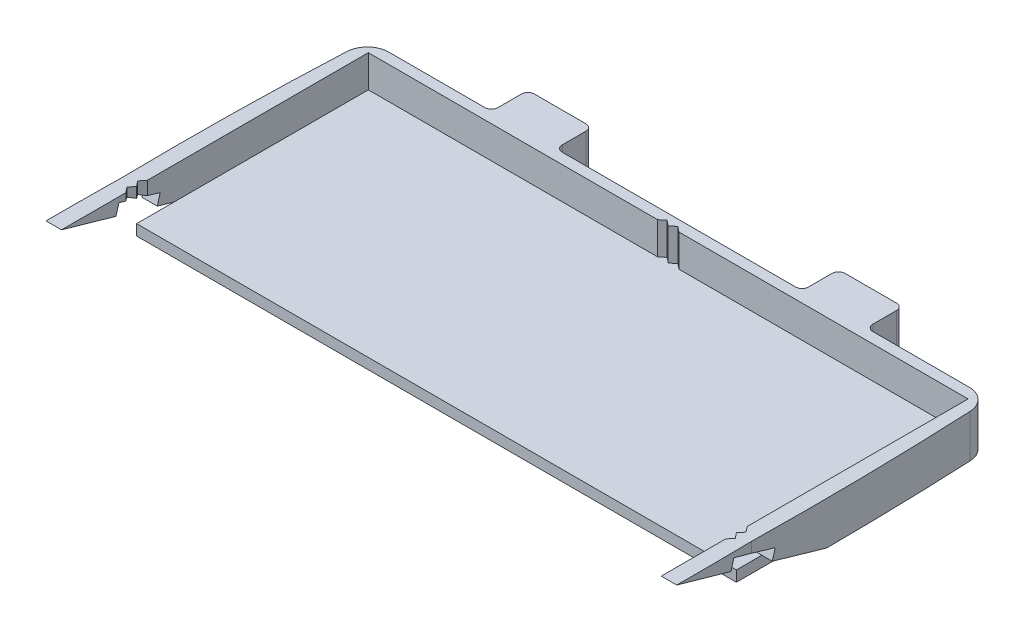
ISO-10303-21;
HEADER;
FILE_DESCRIPTION(('STEP AP214'),'2;1');
FILE_NAME('part.step','',(''),(''),'','','');
FILE_SCHEMA(('AUTOMOTIVE_DESIGN { 1 0 10303 214 1 1 1 1 }'));
ENDSEC;
DATA;
#1=APPLICATION_CONTEXT('core data for automotive mechanical design processes');
#2=APPLICATION_PROTOCOL_DEFINITION('international standard','automotive_design',2000,#1);
#3=PRODUCT_CONTEXT('',#1,'mechanical');
#4=PRODUCT('Part','Part','',(#3));
#5=PRODUCT_RELATED_PRODUCT_CATEGORY('part','',(#4));
#6=PRODUCT_DEFINITION_FORMATION('','',#4);
#7=PRODUCT_DEFINITION_CONTEXT('part definition',#1,'design');
#8=PRODUCT_DEFINITION('design','',#6,#7);
#9=PRODUCT_DEFINITION_SHAPE('','',#8);
#10=(LENGTH_UNIT() NAMED_UNIT(*) SI_UNIT(.MILLI.,.METRE.));
#11=(NAMED_UNIT(*) PLANE_ANGLE_UNIT() SI_UNIT($,.RADIAN.));
#12=(NAMED_UNIT(*) SI_UNIT($,.STERADIAN.) SOLID_ANGLE_UNIT());
#13=UNCERTAINTY_MEASURE_WITH_UNIT(LENGTH_MEASURE(1.E-05),#10,'distance_accuracy_value','');
#14=(GEOMETRIC_REPRESENTATION_CONTEXT(3) GLOBAL_UNCERTAINTY_ASSIGNED_CONTEXT((#13)) GLOBAL_UNIT_ASSIGNED_CONTEXT((#10,
#11,#12)) REPRESENTATION_CONTEXT('',''));
#15=CARTESIAN_POINT('',(0.,0.,0.));
#16=DIRECTION('',(0.,0.,1.));
#17=DIRECTION('',(1.,0.,0.));
#18=AXIS2_PLACEMENT_3D('',#15,#16,#17);
#19=CARTESIAN_POINT('',(-146.922773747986,0.,-35.));
#20=DIRECTION('',(0.,0.961523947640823,-0.274721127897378));
#21=DIRECTION('',(0.,0.274721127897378,0.961523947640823));
#22=AXIS2_PLACEMENT_3D('',#19,#20,#21);
#23=PLANE('',#22);
#24=DIRECTION('',(0.,0.274721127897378,0.961523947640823));
#25=VECTOR('',#24,1.);
#26=CARTESIAN_POINT('',(139.7,-132066.226415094,-462266.79245283));
#27=LINE('',#26,#25);
#28=CARTESIAN_POINT('',(139.7,0.,-35.));
#29=VERTEX_POINT('',#28);
#30=CARTESIAN_POINT('',(139.7,5.,-17.4999999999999));
#31=VERTEX_POINT('',#30);
#32=EDGE_CURVE('E117',#29,#31,#27,.T.);
#33=ORIENTED_EDGE('',*,*,#32,.F.);
#34=DIRECTION('',(1.,0.,0.));
#35=VECTOR('',#34,1.);
#36=CARTESIAN_POINT('',(-146.922773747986,0.,-35.));
#37=LINE('',#36,#35);
#38=CARTESIAN_POINT('',(146.90706839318,0.,-35.));
#39=VERTEX_POINT('',#38);
#40=EDGE_CURVE('E499',#29,#39,#37,.T.);
#41=ORIENTED_EDGE('',*,*,#40,.T.);
#42=CARTESIAN_POINT('',(-1483.47531380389,2.04463886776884,-27.843763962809));
#43=DIRECTION('',(0.,0.961523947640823,-0.274721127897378));
#44=DIRECTION('',(0.,-0.274721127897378,-0.961523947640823));
#45=AXIS2_PLACEMENT_3D('',#42,#43,#44);
#46=ELLIPSE('',#45,1695.6396058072,1630.39808755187);
#47=CARTESIAN_POINT('',(146.820869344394,7.25278872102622,-9.61523947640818));
#48=VERTEX_POINT('',#47);
#49=EDGE_CURVE('E552',#39,#48,#46,.F.);
#50=ORIENTED_EDGE('',*,*,#49,.T.);
#51=DIRECTION('',(1.,0.,0.));
#52=VECTOR('',#51,1.);
#53=CARTESIAN_POINT('',(-146.922773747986,7.25278872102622,-9.61523947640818));
#54=LINE('',#53,#52);
#55=CARTESIAN_POINT('',(139.7,7.25278872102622,-9.61523947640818));
#56=VERTEX_POINT('',#55);
#57=EDGE_CURVE('E494',#56,#48,#54,.T.);
#58=ORIENTED_EDGE('',*,*,#57,.F.);
#59=DIRECTION('',(0.,-0.274721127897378,-0.961523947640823));
#60=VECTOR('',#59,1.);
#61=CARTESIAN_POINT('',(139.7,10.7547169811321,2.64150943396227));
#62=LINE('',#61,#60);
#63=EDGE_CURVE('E556',#56,#31,#62,.T.);
#64=ORIENTED_EDGE('',*,*,#63,.T.);
#65=EDGE_LOOP('',(#33,#41,#50,#58,#64));
#66=FACE_BOUND('',#65,.T.);
#67=ADVANCED_FACE('F102',(#66),#23,.F.);
#68=DIRECTION('',(0.,-0.274721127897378,-0.961523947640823));
#69=VECTOR('',#68,1.);
#70=CARTESIAN_POINT('',(-139.7,-132065.849056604,-462265.471698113));
#71=LINE('',#70,#69);
#72=CARTESIAN_POINT('',(-139.7,5.,-17.4999999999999));
#73=VERTEX_POINT('',#72);
#74=CARTESIAN_POINT('',(-139.7,0.,-35.0000000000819));
#75=VERTEX_POINT('',#74);
#76=EDGE_CURVE('E479',#73,#75,#71,.T.);
#77=ORIENTED_EDGE('',*,*,#76,.F.);
#78=DIRECTION('',(0.,0.274721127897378,0.961523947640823));
#79=VECTOR('',#78,1.);
#80=CARTESIAN_POINT('',(-139.7,10.7547169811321,2.64150943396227));
#81=LINE('',#80,#79);
#82=CARTESIAN_POINT('',(-139.7,7.25278872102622,-9.61523947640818));
#83=VERTEX_POINT('',#82);
#84=EDGE_CURVE('E554',#73,#83,#81,.T.);
#85=ORIENTED_EDGE('',*,*,#84,.T.);
#86=CARTESIAN_POINT('',(-146.820869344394,7.25278872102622,-9.61523947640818));
#87=VERTEX_POINT('',#86);
#88=EDGE_CURVE('E493',#87,#83,#54,.T.);
#89=ORIENTED_EDGE('',*,*,#88,.F.);
#90=CARTESIAN_POINT('',(1483.47531380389,2.04463886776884,-27.843763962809));
#91=DIRECTION('',(0.,0.961523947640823,-0.274721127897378));
#92=DIRECTION('',(0.,-0.274721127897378,-0.961523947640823));
#93=AXIS2_PLACEMENT_3D('',#90,#91,#92);
#94=ELLIPSE('',#93,1695.6396058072,1630.39808755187);
#95=CARTESIAN_POINT('',(-146.90706839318,0.,-35.));
#96=VERTEX_POINT('',#95);
#97=EDGE_CURVE('E110',#96,#87,#94,.T.);
#98=ORIENTED_EDGE('',*,*,#97,.F.);
#99=EDGE_CURVE('E497',#96,#75,#37,.T.);
#100=ORIENTED_EDGE('',*,*,#99,.T.);
#101=EDGE_LOOP('',(#77,#85,#89,#98,#100));
#102=FACE_BOUND('',#101,.T.);
#103=ADVANCED_FACE('F848',(#102),#23,.F.);
#104=CARTESIAN_POINT('',(139.7,20.,0.));
#105=DIRECTION('',(-1.,0.,0.));
#106=DIRECTION('',(0.,0.,1.));
#107=AXIS2_PLACEMENT_3D('',#104,#105,#106);
#108=PLANE('',#107);
#109=DIRECTION('',(0.,-0.274721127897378,-0.961523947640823));
#110=VECTOR('',#109,1.);
#111=CARTESIAN_POINT('',(139.7,15.5623367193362,1.26790379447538));
#112=LINE('',#111,#110);
#113=CARTESIAN_POINT('',(139.7,13.7715070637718,-5.));
#114=VERTEX_POINT('',#113);
#115=CARTESIAN_POINT('',(139.7,12.0604084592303,-10.9888451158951));
#116=VERTEX_POINT('',#115);
#117=EDGE_CURVE('E537',#114,#116,#112,.T.);
#118=ORIENTED_EDGE('',*,*,#117,.F.);
#119=DIRECTION('',(0.,1.,0.));
#120=VECTOR('',#119,1.);
#121=CARTESIAN_POINT('',(139.7,5.,-5.));
#122=LINE('',#121,#120);
#123=CARTESIAN_POINT('',(139.7,20.,-5.));
#124=VERTEX_POINT('',#123);
#125=EDGE_CURVE('E659',#114,#124,#122,.T.);
#126=ORIENTED_EDGE('',*,*,#125,.T.);
#127=DIRECTION('',(0.,0.,-1.));
#128=VECTOR('',#127,1.);
#129=CARTESIAN_POINT('',(139.7,20.,0.));
#130=LINE('',#129,#128);
#131=CARTESIAN_POINT('',(139.7,20.,-107.95));
#132=VERTEX_POINT('',#131);
#133=EDGE_CURVE('E692',#124,#132,#130,.T.);
#134=ORIENTED_EDGE('',*,*,#133,.T.);
#135=DIRECTION('',(0.,-1.,0.));
#136=VECTOR('',#135,1.);
#137=CARTESIAN_POINT('',(139.7,20.,-107.95));
#138=LINE('',#137,#136);
#139=CARTESIAN_POINT('',(139.7,5.,-107.95));
#140=VERTEX_POINT('',#139);
#141=EDGE_CURVE('E738',#132,#140,#138,.T.);
#142=ORIENTED_EDGE('',*,*,#141,.T.);
#143=DIRECTION('',(0.,0.,-1.));
#144=VECTOR('',#143,1.);
#145=CARTESIAN_POINT('',(139.7,5.,387.394735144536));
#146=LINE('',#145,#144);
#147=EDGE_CURVE('E586',#31,#140,#146,.T.);
#148=ORIENTED_EDGE('',*,*,#147,.F.);
#149=ORIENTED_EDGE('',*,*,#63,.F.);
#150=DIRECTION('',(0.,-0.961523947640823,0.274721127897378));
#151=VECTOR('',#150,1.);
#152=CARTESIAN_POINT('',(139.7,16.4980717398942,-12.2567489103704));
#153=LINE('',#152,#151);
#154=EDGE_CURVE('E562',#116,#56,#153,.T.);
#155=ORIENTED_EDGE('',*,*,#154,.F.);
#156=EDGE_LOOP('',(#118,#126,#134,#142,#148,#149,#155));
#157=FACE_BOUND('',#156,.T.);
#158=ADVANCED_FACE('F866',(#157),#108,.T.);
#159=DIRECTION('',(0.,-0.274721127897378,-0.961523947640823));
#160=VECTOR('',#159,1.);
#161=CARTESIAN_POINT('',(139.7,10.7547169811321,2.64150943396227));
#162=LINE('',#161,#160);
#163=CARTESIAN_POINT('',(139.7,20.,35.0000000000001));
#164=VERTEX_POINT('',#163);
#165=CARTESIAN_POINT('',(139.7,12.7472112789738,9.61523947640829));
#166=VERTEX_POINT('',#165);
#167=EDGE_CURVE('E550',#164,#166,#162,.T.);
#168=ORIENTED_EDGE('',*,*,#167,.F.);
#169=CARTESIAN_POINT('',(139.7,20.,5.));
#170=VERTEX_POINT('',#169);
#171=EDGE_CURVE('E693',#164,#170,#130,.T.);
#172=ORIENTED_EDGE('',*,*,#171,.T.);
#173=DIRECTION('',(0.,1.,0.));
#174=VECTOR('',#173,1.);
#175=CARTESIAN_POINT('',(139.7,5.,5.));
#176=LINE('',#175,#174);
#177=CARTESIAN_POINT('',(139.7,16.6286499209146,5.));
#178=VERTEX_POINT('',#177);
#179=EDGE_CURVE('E620',#178,#170,#176,.T.);
#180=ORIENTED_EDGE('',*,*,#179,.F.);
#181=DIRECTION('',(0.,-0.274721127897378,-0.961523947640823));
#182=VECTOR('',#181,1.);
#183=CARTESIAN_POINT('',(139.7,15.5623367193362,1.26790379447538));
#184=LINE('',#183,#182);
#185=CARTESIAN_POINT('',(139.7,17.5548310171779,8.2416338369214));
#186=VERTEX_POINT('',#185);
#187=EDGE_CURVE('E535',#186,#178,#184,.T.);
#188=ORIENTED_EDGE('',*,*,#187,.F.);
#189=DIRECTION('',(0.,0.961523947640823,-0.274721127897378));
#190=VECTOR('',#189,1.);
#191=CARTESIAN_POINT('',(139.7,21.9924942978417,6.97373004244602));
#192=LINE('',#191,#190);
#193=EDGE_CURVE('E544',#166,#186,#192,.T.);
#194=ORIENTED_EDGE('',*,*,#193,.F.);
#195=EDGE_LOOP('',(#168,#172,#180,#188,#194));
#196=FACE_BOUND('',#195,.T.);
#197=ADVANCED_FACE('F1043',(#196),#108,.T.);
#198=CARTESIAN_POINT('',(-139.7,20.,0.));
#199=DIRECTION('',(1.,0.,0.));
#200=DIRECTION('',(0.,0.,-1.));
#201=AXIS2_PLACEMENT_3D('',#198,#199,#200);
#202=PLANE('',#201);
#203=DIRECTION('',(0.,0.274721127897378,0.961523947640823));
#204=VECTOR('',#203,1.);
#205=CARTESIAN_POINT('',(-139.7,10.7547169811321,2.64150943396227));
#206=LINE('',#205,#204);
#207=CARTESIAN_POINT('',(-139.7,12.7472112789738,9.61523947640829));
#208=VERTEX_POINT('',#207);
#209=CARTESIAN_POINT('',(-139.7,20.,35.0000000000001));
#210=VERTEX_POINT('',#209);
#211=EDGE_CURVE('E548',#208,#210,#206,.T.);
#212=ORIENTED_EDGE('',*,*,#211,.F.);
#213=DIRECTION('',(0.,-0.961523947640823,0.274721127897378));
#214=VECTOR('',#213,1.);
#215=CARTESIAN_POINT('',(-139.7,21.9924942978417,6.97373004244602));
#216=LINE('',#215,#214);
#217=CARTESIAN_POINT('',(-139.7,17.5548310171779,8.2416338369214));
#218=VERTEX_POINT('',#217);
#219=EDGE_CURVE('E542',#218,#208,#216,.T.);
#220=ORIENTED_EDGE('',*,*,#219,.F.);
#221=DIRECTION('',(0.,0.274721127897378,0.961523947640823));
#222=VECTOR('',#221,1.);
#223=CARTESIAN_POINT('',(-139.7,15.5623367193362,1.26790379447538));
#224=LINE('',#223,#222);
#225=CARTESIAN_POINT('',(-139.7,16.6286499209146,5.));
#226=VERTEX_POINT('',#225);
#227=EDGE_CURVE('E519',#226,#218,#224,.T.);
#228=ORIENTED_EDGE('',*,*,#227,.F.);
#229=DIRECTION('',(0.,1.,0.));
#230=VECTOR('',#229,1.);
#231=CARTESIAN_POINT('',(-139.7,5.,5.));
#232=LINE('',#231,#230);
#233=CARTESIAN_POINT('',(-139.7,20.,5.));
#234=VERTEX_POINT('',#233);
#235=EDGE_CURVE('E611',#226,#234,#232,.T.);
#236=ORIENTED_EDGE('',*,*,#235,.T.);
#237=DIRECTION('',(0.,0.,1.));
#238=VECTOR('',#237,1.);
#239=CARTESIAN_POINT('',(-139.7,20.,0.));
#240=LINE('',#239,#238);
#241=EDGE_CURVE('E688',#234,#210,#240,.T.);
#242=ORIENTED_EDGE('',*,*,#241,.T.);
#243=EDGE_LOOP('',(#212,#220,#228,#236,#242));
#244=FACE_BOUND('',#243,.T.);
#245=ADVANCED_FACE('F1046',(#244),#202,.T.);
#246=DIRECTION('',(0.,0.274721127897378,0.961523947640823));
#247=VECTOR('',#246,1.);
#248=CARTESIAN_POINT('',(-139.7,15.5623367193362,1.26790379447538));
#249=LINE('',#248,#247);
#250=CARTESIAN_POINT('',(-139.7,12.0604084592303,-10.9888451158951));
#251=VERTEX_POINT('',#250);
#252=CARTESIAN_POINT('',(-139.7,13.7715070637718,-5.));
#253=VERTEX_POINT('',#252);
#254=EDGE_CURVE('E523',#251,#253,#249,.T.);
#255=ORIENTED_EDGE('',*,*,#254,.F.);
#256=DIRECTION('',(0.,0.961523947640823,-0.274721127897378));
#257=VECTOR('',#256,1.);
#258=CARTESIAN_POINT('',(-139.7,16.4980717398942,-12.2567489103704));
#259=LINE('',#258,#257);
#260=EDGE_CURVE('E560',#83,#251,#259,.T.);
#261=ORIENTED_EDGE('',*,*,#260,.F.);
#262=ORIENTED_EDGE('',*,*,#84,.F.);
#263=DIRECTION('',(0.,0.,-1.));
#264=VECTOR('',#263,1.);
#265=CARTESIAN_POINT('',(-139.7,5.,387.394735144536));
#266=LINE('',#265,#264);
#267=CARTESIAN_POINT('',(-139.7,5.,-107.95));
#268=VERTEX_POINT('',#267);
#269=EDGE_CURVE('E451',#73,#268,#266,.T.);
#270=ORIENTED_EDGE('',*,*,#269,.T.);
#271=DIRECTION('',(0.,-1.,0.));
#272=VECTOR('',#271,1.);
#273=CARTESIAN_POINT('',(-139.7,20.,-107.95));
#274=LINE('',#273,#272);
#275=CARTESIAN_POINT('',(-139.7,20.,-107.95));
#276=VERTEX_POINT('',#275);
#277=EDGE_CURVE('E741',#276,#268,#274,.T.);
#278=ORIENTED_EDGE('',*,*,#277,.F.);
#279=CARTESIAN_POINT('',(-139.7,20.,-5.));
#280=VERTEX_POINT('',#279);
#281=EDGE_CURVE('E684',#276,#280,#240,.T.);
#282=ORIENTED_EDGE('',*,*,#281,.T.);
#283=DIRECTION('',(0.,1.,0.));
#284=VECTOR('',#283,1.);
#285=CARTESIAN_POINT('',(-139.7,5.,-5.));
#286=LINE('',#285,#284);
#287=EDGE_CURVE('E631',#253,#280,#286,.T.);
#288=ORIENTED_EDGE('',*,*,#287,.F.);
#289=EDGE_LOOP('',(#255,#261,#262,#270,#278,#282,#288));
#290=FACE_BOUND('',#289,.T.);
#291=ADVANCED_FACE('F896',(#290),#202,.T.);
#292=CARTESIAN_POINT('',(0.,20.,-107.95));
#293=DIRECTION('',(0.,0.,1.));
#294=DIRECTION('',(1.,0.,0.));
#295=AXIS2_PLACEMENT_3D('',#292,#293,#294);
#296=PLANE('',#295);
#297=ORIENTED_EDGE('',*,*,#277,.T.);
#298=DIRECTION('',(-1.,0.,0.));
#299=VECTOR('',#298,1.);
#300=CARTESIAN_POINT('',(-139.7,5.,-107.95));
#301=LINE('',#300,#299);
#302=CARTESIAN_POINT('',(-5.00000000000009,5.,-107.95));
#303=VERTEX_POINT('',#302);
#304=EDGE_CURVE('E589',#303,#268,#301,.T.);
#305=ORIENTED_EDGE('',*,*,#304,.F.);
#306=DIRECTION('',(0.,1.,0.));
#307=VECTOR('',#306,1.);
#308=CARTESIAN_POINT('',(-5.00000000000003,5.,-107.95));
#309=LINE('',#308,#307);
#310=CARTESIAN_POINT('',(-5.00000000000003,20.,-107.95));
#311=VERTEX_POINT('',#310);
#312=EDGE_CURVE('E676',#303,#311,#309,.T.);
#313=ORIENTED_EDGE('',*,*,#312,.T.);
#314=DIRECTION('',(-1.,0.,0.));
#315=VECTOR('',#314,1.);
#316=CARTESIAN_POINT('',(0.,20.,-107.95));
#317=LINE('',#316,#315);
#318=EDGE_CURVE('E687',#311,#276,#317,.T.);
#319=ORIENTED_EDGE('',*,*,#318,.T.);
#320=EDGE_LOOP('',(#297,#305,#313,#319));
#321=FACE_BOUND('',#320,.T.);
#322=ADVANCED_FACE('F891',(#321),#296,.T.);
#323=DIRECTION('',(0.,1.,0.));
#324=VECTOR('',#323,1.);
#325=CARTESIAN_POINT('',(5.00000000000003,5.,-107.95));
#326=LINE('',#325,#324);
#327=CARTESIAN_POINT('',(4.99999999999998,5.,-107.95));
#328=VERTEX_POINT('',#327);
#329=CARTESIAN_POINT('',(5.00000000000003,20.,-107.95));
#330=VERTEX_POINT('',#329);
#331=EDGE_CURVE('E644',#328,#330,#326,.T.);
#332=ORIENTED_EDGE('',*,*,#331,.F.);
#333=EDGE_CURVE('E587',#140,#328,#301,.T.);
#334=ORIENTED_EDGE('',*,*,#333,.F.);
#335=ORIENTED_EDGE('',*,*,#141,.F.);
#336=EDGE_CURVE('E689',#132,#330,#317,.T.);
#337=ORIENTED_EDGE('',*,*,#336,.T.);
#338=EDGE_LOOP('',(#332,#334,#335,#337));
#339=FACE_BOUND('',#338,.T.);
#340=ADVANCED_FACE('F863',(#339),#296,.T.);
#341=CARTESIAN_POINT('',(0.,20.,0.));
#342=DIRECTION('',(0.,1.,0.));
#343=DIRECTION('',(0.,0.,1.));
#344=AXIS2_PLACEMENT_3D('',#341,#342,#343);
#345=PLANE('',#344);
#346=DIRECTION('',(1.,0.,0.));
#347=VECTOR('',#346,1.);
#348=CARTESIAN_POINT('',(-146.922773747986,20.,35.0000000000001));
#349=LINE('',#348,#347);
#350=CARTESIAN_POINT('',(146.90706839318,20.,35.0000000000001));
#351=VERTEX_POINT('',#350);
#352=EDGE_CURVE('E481',#164,#351,#349,.T.);
#353=ORIENTED_EDGE('',*,*,#352,.T.);
#354=CARTESIAN_POINT('',(-1483.47531380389,20.,27.8437639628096));
#355=DIRECTION('',(0.,1.,0.));
#356=DIRECTION('',(0.,0.,1.));
#357=AXIS2_PLACEMENT_3D('',#354,#355,#356);
#358=CIRCLE('',#357,1630.39808755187);
#359=CARTESIAN_POINT('',(146.685,20.,0.));
#360=VERTEX_POINT('',#359);
#361=EDGE_CURVE('E579',#351,#360,#358,.T.);
#362=ORIENTED_EDGE('',*,*,#361,.T.);
#363=CARTESIAN_POINT('',(-1483.47531380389,20.,-27.843763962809));
#364=DIRECTION('',(0.,-1.,0.));
#365=DIRECTION('',(0.,0.,-1.));
#366=AXIS2_PLACEMENT_3D('',#363,#364,#365);
#367=CIRCLE('',#366,1630.39808755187);
#368=CARTESIAN_POINT('',(145.170485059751,20.,-103.413504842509));
#369=VERTEX_POINT('',#368);
#370=EDGE_CURVE('E576',#369,#360,#367,.T.);
#371=ORIENTED_EDGE('',*,*,#370,.F.);
#372=CARTESIAN_POINT('',(135.181232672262,20.,-102.95));
#373=DIRECTION('',(0.,1.,0.));
#374=DIRECTION('',(0.,0.,1.));
#375=AXIS2_PLACEMENT_3D('',#372,#373,#374);
#376=CIRCLE('',#375,10.);
#377=CARTESIAN_POINT('',(135.181232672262,20.,-112.95));
#378=VERTEX_POINT('',#377);
#379=EDGE_CURVE('E827',#369,#378,#376,.T.);
#380=ORIENTED_EDGE('',*,*,#379,.T.);
#381=DIRECTION('',(-1.,0.,0.));
#382=VECTOR('',#381,1.);
#383=CARTESIAN_POINT('',(0.,20.,-112.95));
#384=LINE('',#383,#382);
#385=CARTESIAN_POINT('',(90.35,20.,-112.95));
#386=VERTEX_POINT('',#385);
#387=EDGE_CURVE('E695',#378,#386,#384,.T.);
#388=ORIENTED_EDGE('',*,*,#387,.T.);
#389=CARTESIAN_POINT('',(90.35,20.,-115.95));
#390=DIRECTION('',(0.,1.,0.));
#391=DIRECTION('',(0.,0.,1.));
#392=AXIS2_PLACEMENT_3D('',#389,#390,#391);
#393=CIRCLE('',#392,3.);
#394=CARTESIAN_POINT('',(87.35,20.,-115.95));
#395=VERTEX_POINT('',#394);
#396=EDGE_CURVE('E816',#386,#395,#393,.F.);
#397=ORIENTED_EDGE('',*,*,#396,.T.);
#398=DIRECTION('',(0.,0.,1.));
#399=VECTOR('',#398,1.);
#400=CARTESIAN_POINT('',(87.35,20.,0.));
#401=LINE('',#400,#399);
#402=CARTESIAN_POINT('',(87.35,20.,-126.95));
#403=VERTEX_POINT('',#402);
#404=EDGE_CURVE('E697',#403,#395,#401,.T.);
#405=ORIENTED_EDGE('',*,*,#404,.F.);
#406=CARTESIAN_POINT('',(84.35,20.,-126.95));
#407=DIRECTION('',(0.,1.,0.));
#408=DIRECTION('',(0.,0.,1.));
#409=AXIS2_PLACEMENT_3D('',#406,#407,#408);
#410=CIRCLE('',#409,3.);
#411=CARTESIAN_POINT('',(84.35,20.,-129.95));
#412=VERTEX_POINT('',#411);
#413=EDGE_CURVE('E762',#403,#412,#410,.T.);
#414=ORIENTED_EDGE('',*,*,#413,.T.);
#415=DIRECTION('',(1.,0.,0.));
#416=VECTOR('',#415,1.);
#417=CARTESIAN_POINT('',(0.,20.,-129.95));
#418=LINE('',#417,#416);
#419=CARTESIAN_POINT('',(60.35,20.,-129.95));
#420=VERTEX_POINT('',#419);
#421=EDGE_CURVE('E702',#420,#412,#418,.T.);
#422=ORIENTED_EDGE('',*,*,#421,.F.);
#423=CARTESIAN_POINT('',(60.35,20.,-126.95));
#424=DIRECTION('',(0.,1.,0.));
#425=DIRECTION('',(0.,0.,1.));
#426=AXIS2_PLACEMENT_3D('',#423,#424,#425);
#427=CIRCLE('',#426,3.);
#428=CARTESIAN_POINT('',(57.35,20.,-126.95));
#429=VERTEX_POINT('',#428);
#430=EDGE_CURVE('E764',#420,#429,#427,.T.);
#431=ORIENTED_EDGE('',*,*,#430,.T.);
#432=DIRECTION('',(0.,0.,-1.));
#433=VECTOR('',#432,1.);
#434=CARTESIAN_POINT('',(57.35,20.,0.));
#435=LINE('',#434,#433);
#436=CARTESIAN_POINT('',(57.35,20.,-115.95));
#437=VERTEX_POINT('',#436);
#438=EDGE_CURVE('E705',#437,#429,#435,.T.);
#439=ORIENTED_EDGE('',*,*,#438,.F.);
#440=CARTESIAN_POINT('',(54.35,20.,-115.95));
#441=DIRECTION('',(0.,1.,0.));
#442=DIRECTION('',(0.,0.,1.));
#443=AXIS2_PLACEMENT_3D('',#440,#441,#442);
#444=CIRCLE('',#443,3.);
#445=CARTESIAN_POINT('',(54.35,20.,-112.95));
#446=VERTEX_POINT('',#445);
#447=EDGE_CURVE('E811',#437,#446,#444,.F.);
#448=ORIENTED_EDGE('',*,*,#447,.T.);
#449=CARTESIAN_POINT('',(-54.35,20.,-112.95));
#450=VERTEX_POINT('',#449);
#451=EDGE_CURVE('E699',#446,#450,#384,.T.);
#452=ORIENTED_EDGE('',*,*,#451,.T.);
#453=CARTESIAN_POINT('',(-54.35,20.,-115.95));
#454=DIRECTION('',(0.,1.,0.));
#455=DIRECTION('',(0.,0.,1.));
#456=AXIS2_PLACEMENT_3D('',#453,#454,#455);
#457=CIRCLE('',#456,3.);
#458=CARTESIAN_POINT('',(-57.35,20.,-115.95));
#459=VERTEX_POINT('',#458);
#460=EDGE_CURVE('E803',#450,#459,#457,.F.);
#461=ORIENTED_EDGE('',*,*,#460,.T.);
#462=DIRECTION('',(0.,0.,-1.));
#463=VECTOR('',#462,1.);
#464=CARTESIAN_POINT('',(-57.35,20.,0.));
#465=LINE('',#464,#463);
#466=CARTESIAN_POINT('',(-57.35,20.,-126.95));
#467=VERTEX_POINT('',#466);
#468=EDGE_CURVE('E708',#459,#467,#465,.T.);
#469=ORIENTED_EDGE('',*,*,#468,.T.);
#470=CARTESIAN_POINT('',(-60.35,20.,-126.95));
#471=DIRECTION('',(0.,1.,0.));
#472=DIRECTION('',(0.,0.,1.));
#473=AXIS2_PLACEMENT_3D('',#470,#471,#472);
#474=CIRCLE('',#473,3.);
#475=CARTESIAN_POINT('',(-60.35,20.,-129.95));
#476=VERTEX_POINT('',#475);
#477=EDGE_CURVE('E768',#467,#476,#474,.T.);
#478=ORIENTED_EDGE('',*,*,#477,.T.);
#479=DIRECTION('',(-1.,0.,0.));
#480=VECTOR('',#479,1.);
#481=CARTESIAN_POINT('',(0.,20.,-129.95));
#482=LINE('',#481,#480);
#483=CARTESIAN_POINT('',(-84.35,20.,-129.95));
#484=VERTEX_POINT('',#483);
#485=EDGE_CURVE('E711',#476,#484,#482,.T.);
#486=ORIENTED_EDGE('',*,*,#485,.T.);
#487=CARTESIAN_POINT('',(-84.35,20.,-126.95));
#488=DIRECTION('',(0.,1.,0.));
#489=DIRECTION('',(0.,0.,1.));
#490=AXIS2_PLACEMENT_3D('',#487,#488,#489);
#491=CIRCLE('',#490,3.);
#492=CARTESIAN_POINT('',(-87.35,20.,-126.95));
#493=VERTEX_POINT('',#492);
#494=EDGE_CURVE('E766',#484,#493,#491,.T.);
#495=ORIENTED_EDGE('',*,*,#494,.T.);
#496=DIRECTION('',(0.,0.,1.));
#497=VECTOR('',#496,1.);
#498=CARTESIAN_POINT('',(-87.35,20.,0.));
#499=LINE('',#498,#497);
#500=CARTESIAN_POINT('',(-87.35,20.,-115.95));
#501=VERTEX_POINT('',#500);
#502=EDGE_CURVE('E714',#493,#501,#499,.T.);
#503=ORIENTED_EDGE('',*,*,#502,.T.);
#504=CARTESIAN_POINT('',(-90.35,20.,-115.95));
#505=DIRECTION('',(0.,1.,0.));
#506=DIRECTION('',(0.,0.,1.));
#507=AXIS2_PLACEMENT_3D('',#504,#505,#506);
#508=CIRCLE('',#507,3.);
#509=CARTESIAN_POINT('',(-90.35,20.,-112.95));
#510=VERTEX_POINT('',#509);
#511=EDGE_CURVE('E807',#501,#510,#508,.F.);
#512=ORIENTED_EDGE('',*,*,#511,.T.);
#513=CARTESIAN_POINT('',(-135.181232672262,20.,-112.95));
#514=VERTEX_POINT('',#513);
#515=EDGE_CURVE('E698',#510,#514,#384,.T.);
#516=ORIENTED_EDGE('',*,*,#515,.T.);
#517=CARTESIAN_POINT('',(-135.181232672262,20.,-102.95));
#518=DIRECTION('',(0.,1.,0.));
#519=DIRECTION('',(0.,0.,1.));
#520=AXIS2_PLACEMENT_3D('',#517,#518,#519);
#521=CIRCLE('',#520,10.);
#522=CARTESIAN_POINT('',(-145.170485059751,20.,-103.413504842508));
#523=VERTEX_POINT('',#522);
#524=EDGE_CURVE('E829',#514,#523,#521,.T.);
#525=ORIENTED_EDGE('',*,*,#524,.T.);
#526=CARTESIAN_POINT('',(1483.47531380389,20.,-27.843763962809));
#527=DIRECTION('',(0.,1.,0.));
#528=DIRECTION('',(0.,0.,-1.));
#529=AXIS2_PLACEMENT_3D('',#526,#527,#528);
#530=CIRCLE('',#529,1630.39808755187);
#531=CARTESIAN_POINT('',(-146.685,20.,0.));
#532=VERTEX_POINT('',#531);
#533=EDGE_CURVE('E565',#523,#532,#530,.T.);
#534=ORIENTED_EDGE('',*,*,#533,.T.);
#535=CARTESIAN_POINT('',(1483.47531380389,20.,27.8437639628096));
#536=DIRECTION('',(0.,-1.,0.));
#537=DIRECTION('',(0.,0.,1.));
#538=AXIS2_PLACEMENT_3D('',#535,#536,#537);
#539=CIRCLE('',#538,1630.39808755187);
#540=CARTESIAN_POINT('',(-146.90706839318,20.,35.0000000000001));
#541=VERTEX_POINT('',#540);
#542=EDGE_CURVE('E568',#541,#532,#539,.T.);
#543=ORIENTED_EDGE('',*,*,#542,.F.);
#544=EDGE_CURVE('E502',#541,#210,#349,.T.);
#545=ORIENTED_EDGE('',*,*,#544,.T.);
#546=ORIENTED_EDGE('',*,*,#241,.F.);
#547=DIRECTION('',(0.624695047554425,0.,0.78086880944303));
#548=VECTOR('',#547,1.);
#549=CARTESIAN_POINT('',(-141.7,20.,2.5));
#550=LINE('',#549,#548);
#551=CARTESIAN_POINT('',(-141.7,20.,2.5));
#552=VERTEX_POINT('',#551);
#553=EDGE_CURVE('E607',#552,#234,#550,.T.);
#554=ORIENTED_EDGE('',*,*,#553,.F.);
#555=DIRECTION('',(-0.624695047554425,0.,0.78086880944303));
#556=VECTOR('',#555,1.);
#557=CARTESIAN_POINT('',(-139.7,20.,0.));
#558=LINE('',#557,#556);
#559=CARTESIAN_POINT('',(-139.7,20.,0.));
#560=VERTEX_POINT('',#559);
#561=EDGE_CURVE('E596',#560,#552,#558,.T.);
#562=ORIENTED_EDGE('',*,*,#561,.F.);
#563=DIRECTION('',(-0.624695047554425,0.,-0.78086880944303));
#564=VECTOR('',#563,1.);
#565=CARTESIAN_POINT('',(-139.7,20.,0.));
#566=LINE('',#565,#564);
#567=CARTESIAN_POINT('',(-141.7,20.,-2.5));
#568=VERTEX_POINT('',#567);
#569=EDGE_CURVE('E628',#560,#568,#566,.T.);
#570=ORIENTED_EDGE('',*,*,#569,.T.);
#571=DIRECTION('',(0.624695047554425,0.,-0.78086880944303));
#572=VECTOR('',#571,1.);
#573=CARTESIAN_POINT('',(-141.7,20.,-2.5));
#574=LINE('',#573,#572);
#575=EDGE_CURVE('E623',#568,#280,#574,.T.);
#576=ORIENTED_EDGE('',*,*,#575,.T.);
#577=ORIENTED_EDGE('',*,*,#281,.F.);
#578=ORIENTED_EDGE('',*,*,#318,.F.);
#579=DIRECTION('',(-0.78086880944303,0.,0.624695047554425));
#580=VECTOR('',#579,1.);
#581=CARTESIAN_POINT('',(-5.00000000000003,20.,-107.95));
#582=LINE('',#581,#580);
#583=CARTESIAN_POINT('',(-2.50000000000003,20.,-109.95));
#584=VERTEX_POINT('',#583);
#585=EDGE_CURVE('E669',#584,#311,#582,.T.);
#586=ORIENTED_EDGE('',*,*,#585,.F.);
#587=DIRECTION('',(-0.78086880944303,0.,-0.624695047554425));
#588=VECTOR('',#587,1.);
#589=CARTESIAN_POINT('',(-2.50000000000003,20.,-109.95));
#590=LINE('',#589,#588);
#591=CARTESIAN_POINT('',(0.,20.,-107.95));
#592=VERTEX_POINT('',#591);
#593=EDGE_CURVE('E661',#592,#584,#590,.T.);
#594=ORIENTED_EDGE('',*,*,#593,.F.);
#595=DIRECTION('',(0.78086880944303,0.,-0.624695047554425));
#596=VECTOR('',#595,1.);
#597=CARTESIAN_POINT('',(2.50000000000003,20.,-109.95));
#598=LINE('',#597,#596);
#599=CARTESIAN_POINT('',(2.50000000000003,20.,-109.95));
#600=VERTEX_POINT('',#599);
#601=EDGE_CURVE('E642',#592,#600,#598,.T.);
#602=ORIENTED_EDGE('',*,*,#601,.T.);
#603=DIRECTION('',(0.78086880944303,0.,0.624695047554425));
#604=VECTOR('',#603,1.);
#605=CARTESIAN_POINT('',(5.00000000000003,20.,-107.95));
#606=LINE('',#605,#604);
#607=EDGE_CURVE('E634',#600,#330,#606,.T.);
#608=ORIENTED_EDGE('',*,*,#607,.T.);
#609=ORIENTED_EDGE('',*,*,#336,.F.);
#610=ORIENTED_EDGE('',*,*,#133,.F.);
#611=DIRECTION('',(-0.624695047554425,0.,-0.78086880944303));
#612=VECTOR('',#611,1.);
#613=CARTESIAN_POINT('',(141.7,20.,-2.5));
#614=LINE('',#613,#612);
#615=CARTESIAN_POINT('',(141.7,20.,-2.5));
#616=VERTEX_POINT('',#615);
#617=EDGE_CURVE('E655',#616,#124,#614,.T.);
#618=ORIENTED_EDGE('',*,*,#617,.F.);
#619=DIRECTION('',(0.624695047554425,0.,-0.78086880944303));
#620=VECTOR('',#619,1.);
#621=CARTESIAN_POINT('',(139.7,20.,0.));
#622=LINE('',#621,#620);
#623=CARTESIAN_POINT('',(139.7,20.,0.));
#624=VERTEX_POINT('',#623);
#625=EDGE_CURVE('E651',#624,#616,#622,.T.);
#626=ORIENTED_EDGE('',*,*,#625,.F.);
#627=DIRECTION('',(0.624695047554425,0.,0.78086880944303));
#628=VECTOR('',#627,1.);
#629=CARTESIAN_POINT('',(139.7,20.,0.));
#630=LINE('',#629,#628);
#631=CARTESIAN_POINT('',(141.7,20.,2.5));
#632=VERTEX_POINT('',#631);
#633=EDGE_CURVE('E617',#624,#632,#630,.T.);
#634=ORIENTED_EDGE('',*,*,#633,.T.);
#635=DIRECTION('',(-0.624695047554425,0.,0.78086880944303));
#636=VECTOR('',#635,1.);
#637=CARTESIAN_POINT('',(141.7,20.,2.5));
#638=LINE('',#637,#636);
#639=EDGE_CURVE('E613',#632,#170,#638,.T.);
#640=ORIENTED_EDGE('',*,*,#639,.T.);
#641=ORIENTED_EDGE('',*,*,#171,.F.);
#642=EDGE_LOOP('',(#353,#362,#371,#380,#388,#397,#405,#414,#422,#431,#439,#448,#452,#461,#469,
#478,#486,#495,#503,#512,#516,#525,#534,#543,#545,#546,#554,#562,#570,#576,#577,#578,#586,#594,
#602,#608,#609,#610,#618,#626,#634,#640,#641));
#643=FACE_BOUND('',#642,.T.);
#644=ADVANCED_FACE('F871',(#643),#345,.T.);
#645=CARTESIAN_POINT('',(0.,20.,-112.95));
#646=DIRECTION('',(0.,0.,1.));
#647=DIRECTION('',(1.,0.,0.));
#648=AXIS2_PLACEMENT_3D('',#645,#646,#647);
#649=PLANE('',#648);
#650=ORIENTED_EDGE('',*,*,#387,.F.);
#651=DIRECTION('',(0.,1.,0.));
#652=VECTOR('',#651,1.);
#653=CARTESIAN_POINT('',(135.181232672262,0.,-112.95));
#654=LINE('',#653,#652);
#655=CARTESIAN_POINT('',(135.181232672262,0.,-112.95));
#656=VERTEX_POINT('',#655);
#657=EDGE_CURVE('E831',#378,#656,#654,.F.);
#658=ORIENTED_EDGE('',*,*,#657,.T.);
#659=DIRECTION('',(-1.,0.,0.));
#660=VECTOR('',#659,1.);
#661=CARTESIAN_POINT('',(0.,0.,-112.95));
#662=LINE('',#661,#660);
#663=CARTESIAN_POINT('',(90.35,0.,-112.95));
#664=VERTEX_POINT('',#663);
#665=EDGE_CURVE('E679',#656,#664,#662,.T.);
#666=ORIENTED_EDGE('',*,*,#665,.T.);
#667=DIRECTION('',(0.,-1.,0.));
#668=VECTOR('',#667,1.);
#669=CARTESIAN_POINT('',(90.35,20.,-112.95));
#670=LINE('',#669,#668);
#671=EDGE_CURVE('E798',#664,#386,#670,.F.);
#672=ORIENTED_EDGE('',*,*,#671,.T.);
#673=EDGE_LOOP('',(#650,#658,#666,#672));
#674=FACE_BOUND('',#673,.T.);
#675=ADVANCED_FACE('F1008',(#674),#649,.F.);
#676=CARTESIAN_POINT('',(87.35,20.,0.));
#677=DIRECTION('',(1.,0.,0.));
#678=DIRECTION('',(0.,0.,-1.));
#679=AXIS2_PLACEMENT_3D('',#676,#677,#678);
#680=PLANE('',#679);
#681=DIRECTION('',(0.,0.,1.));
#682=VECTOR('',#681,1.);
#683=CARTESIAN_POINT('',(87.35,0.,0.));
#684=LINE('',#683,#682);
#685=CARTESIAN_POINT('',(87.35,0.,-126.95));
#686=VERTEX_POINT('',#685);
#687=CARTESIAN_POINT('',(87.35,0.,-115.95));
#688=VERTEX_POINT('',#687);
#689=EDGE_CURVE('E718',#686,#688,#684,.T.);
#690=ORIENTED_EDGE('',*,*,#689,.F.);
#691=DIRECTION('',(0.,-1.,0.));
#692=VECTOR('',#691,1.);
#693=CARTESIAN_POINT('',(87.35,20.,-126.95));
#694=LINE('',#693,#692);
#695=EDGE_CURVE('E796',#686,#403,#694,.F.);
#696=ORIENTED_EDGE('',*,*,#695,.T.);
#697=ORIENTED_EDGE('',*,*,#404,.T.);
#698=DIRECTION('',(0.,-1.,0.));
#699=VECTOR('',#698,1.);
#700=CARTESIAN_POINT('',(87.35,20.,-115.95));
#701=LINE('',#700,#699);
#702=EDGE_CURVE('E793',#395,#688,#701,.T.);
#703=ORIENTED_EDGE('',*,*,#702,.T.);
#704=EDGE_LOOP('',(#690,#696,#697,#703));
#705=FACE_BOUND('',#704,.T.);
#706=ADVANCED_FACE('F1036',(#705),#680,.T.);
#707=CARTESIAN_POINT('',(0.,20.,-129.95));
#708=DIRECTION('',(0.,0.,-1.));
#709=DIRECTION('',(-1.,0.,0.));
#710=AXIS2_PLACEMENT_3D('',#707,#708,#709);
#711=PLANE('',#710);
#712=DIRECTION('',(1.,0.,0.));
#713=VECTOR('',#712,1.);
#714=CARTESIAN_POINT('',(0.,0.,-129.95));
#715=LINE('',#714,#713);
#716=CARTESIAN_POINT('',(60.35,0.,-129.95));
#717=VERTEX_POINT('',#716);
#718=CARTESIAN_POINT('',(84.35,0.,-129.95));
#719=VERTEX_POINT('',#718);
#720=EDGE_CURVE('E723',#717,#719,#715,.T.);
#721=ORIENTED_EDGE('',*,*,#720,.F.);
#722=DIRECTION('',(0.,-1.,0.));
#723=VECTOR('',#722,1.);
#724=CARTESIAN_POINT('',(60.35,20.,-129.95));
#725=LINE('',#724,#723);
#726=EDGE_CURVE('E791',#717,#420,#725,.F.);
#727=ORIENTED_EDGE('',*,*,#726,.T.);
#728=ORIENTED_EDGE('',*,*,#421,.T.);
#729=DIRECTION('',(0.,-1.,0.));
#730=VECTOR('',#729,1.);
#731=CARTESIAN_POINT('',(84.35,20.,-129.95));
#732=LINE('',#731,#730);
#733=EDGE_CURVE('E788',#412,#719,#732,.T.);
#734=ORIENTED_EDGE('',*,*,#733,.T.);
#735=EDGE_LOOP('',(#721,#727,#728,#734));
#736=FACE_BOUND('',#735,.T.);
#737=ADVANCED_FACE('F1032',(#736),#711,.T.);
#738=CARTESIAN_POINT('',(57.35,20.,0.));
#739=DIRECTION('',(-1.,0.,0.));
#740=DIRECTION('',(0.,0.,1.));
#741=AXIS2_PLACEMENT_3D('',#738,#739,#740);
#742=PLANE('',#741);
#743=DIRECTION('',(0.,0.,-1.));
#744=VECTOR('',#743,1.);
#745=CARTESIAN_POINT('',(57.35,0.,0.));
#746=LINE('',#745,#744);
#747=CARTESIAN_POINT('',(57.35,0.,-115.95));
#748=VERTEX_POINT('',#747);
#749=CARTESIAN_POINT('',(57.35,0.,-126.95));
#750=VERTEX_POINT('',#749);
#751=EDGE_CURVE('E726',#748,#750,#746,.T.);
#752=ORIENTED_EDGE('',*,*,#751,.F.);
#753=DIRECTION('',(0.,-1.,0.));
#754=VECTOR('',#753,1.);
#755=CARTESIAN_POINT('',(57.35,20.,-115.95));
#756=LINE('',#755,#754);
#757=EDGE_CURVE('E786',#748,#437,#756,.F.);
#758=ORIENTED_EDGE('',*,*,#757,.T.);
#759=ORIENTED_EDGE('',*,*,#438,.T.);
#760=DIRECTION('',(0.,-1.,0.));
#761=VECTOR('',#760,1.);
#762=CARTESIAN_POINT('',(57.35,20.,-126.95));
#763=LINE('',#762,#761);
#764=EDGE_CURVE('E783',#429,#750,#763,.T.);
#765=ORIENTED_EDGE('',*,*,#764,.T.);
#766=EDGE_LOOP('',(#752,#758,#759,#765));
#767=FACE_BOUND('',#766,.T.);
#768=ADVANCED_FACE('F1029',(#767),#742,.T.);
#769=CARTESIAN_POINT('',(54.35,0.,-112.95));
#770=VERTEX_POINT('',#769);
#771=CARTESIAN_POINT('',(-54.35,0.,-112.95));
#772=VERTEX_POINT('',#771);
#773=EDGE_CURVE('E719',#770,#772,#662,.T.);
#774=ORIENTED_EDGE('',*,*,#773,.T.);
#775=DIRECTION('',(0.,-1.,0.));
#776=VECTOR('',#775,1.);
#777=CARTESIAN_POINT('',(-54.35,20.,-112.95));
#778=LINE('',#777,#776);
#779=EDGE_CURVE('E773',#772,#450,#778,.F.);
#780=ORIENTED_EDGE('',*,*,#779,.T.);
#781=ORIENTED_EDGE('',*,*,#451,.F.);
#782=DIRECTION('',(0.,-1.,0.));
#783=VECTOR('',#782,1.);
#784=CARTESIAN_POINT('',(54.35,20.,-112.95));
#785=LINE('',#784,#783);
#786=EDGE_CURVE('E770',#446,#770,#785,.T.);
#787=ORIENTED_EDGE('',*,*,#786,.T.);
#788=EDGE_LOOP('',(#774,#780,#781,#787));
#789=FACE_BOUND('',#788,.T.);
#790=ADVANCED_FACE('F1017',(#789),#649,.F.);
#791=CARTESIAN_POINT('',(-57.35,20.,0.));
#792=DIRECTION('',(-1.,0.,0.));
#793=DIRECTION('',(0.,0.,1.));
#794=AXIS2_PLACEMENT_3D('',#791,#792,#793);
#795=PLANE('',#794);
#796=DIRECTION('',(0.,0.,-1.));
#797=VECTOR('',#796,1.);
#798=CARTESIAN_POINT('',(-57.35,0.,0.));
#799=LINE('',#798,#797);
#800=CARTESIAN_POINT('',(-57.35,0.,-115.95));
#801=VERTEX_POINT('',#800);
#802=CARTESIAN_POINT('',(-57.35,0.,-126.95));
#803=VERTEX_POINT('',#802);
#804=EDGE_CURVE('E729',#801,#803,#799,.T.);
#805=ORIENTED_EDGE('',*,*,#804,.T.);
#806=DIRECTION('',(0.,-1.,0.));
#807=VECTOR('',#806,1.);
#808=CARTESIAN_POINT('',(-57.35,20.,-126.95));
#809=LINE('',#808,#807);
#810=EDGE_CURVE('E760',#803,#467,#809,.F.);
#811=ORIENTED_EDGE('',*,*,#810,.T.);
#812=ORIENTED_EDGE('',*,*,#468,.F.);
#813=DIRECTION('',(0.,-1.,0.));
#814=VECTOR('',#813,1.);
#815=CARTESIAN_POINT('',(-57.35,0.,-115.95));
#816=LINE('',#815,#814);
#817=EDGE_CURVE('E757',#459,#801,#816,.T.);
#818=ORIENTED_EDGE('',*,*,#817,.T.);
#819=EDGE_LOOP('',(#805,#811,#812,#818));
#820=FACE_BOUND('',#819,.T.);
#821=ADVANCED_FACE('F1024',(#820),#795,.F.);
#822=CARTESIAN_POINT('',(0.,20.,-129.95));
#823=DIRECTION('',(0.,0.,1.));
#824=DIRECTION('',(1.,0.,0.));
#825=AXIS2_PLACEMENT_3D('',#822,#823,#824);
#826=PLANE('',#825);
#827=ORIENTED_EDGE('',*,*,#485,.F.);
#828=DIRECTION('',(0.,-1.,0.));
#829=VECTOR('',#828,1.);
#830=CARTESIAN_POINT('',(-60.35,20.,-129.95));
#831=LINE('',#830,#829);
#832=CARTESIAN_POINT('',(-60.35,0.,-129.95));
#833=VERTEX_POINT('',#832);
#834=EDGE_CURVE('E746',#476,#833,#831,.T.);
#835=ORIENTED_EDGE('',*,*,#834,.T.);
#836=DIRECTION('',(-1.,0.,0.));
#837=VECTOR('',#836,1.);
#838=CARTESIAN_POINT('',(0.,0.,-129.95));
#839=LINE('',#838,#837);
#840=CARTESIAN_POINT('',(-84.35,0.,-129.95));
#841=VERTEX_POINT('',#840);
#842=EDGE_CURVE('E732',#833,#841,#839,.T.);
#843=ORIENTED_EDGE('',*,*,#842,.T.);
#844=DIRECTION('',(0.,-1.,0.));
#845=VECTOR('',#844,1.);
#846=CARTESIAN_POINT('',(-84.35,20.,-129.95));
#847=LINE('',#846,#845);
#848=EDGE_CURVE('E744',#841,#484,#847,.F.);
#849=ORIENTED_EDGE('',*,*,#848,.T.);
#850=EDGE_LOOP('',(#827,#835,#843,#849));
#851=FACE_BOUND('',#850,.T.);
#852=ADVANCED_FACE('F1020',(#851),#826,.F.);
#853=CARTESIAN_POINT('',(-87.35,20.,0.));
#854=DIRECTION('',(1.,0.,0.));
#855=DIRECTION('',(0.,0.,-1.));
#856=AXIS2_PLACEMENT_3D('',#853,#854,#855);
#857=PLANE('',#856);
#858=DIRECTION('',(0.,0.,1.));
#859=VECTOR('',#858,1.);
#860=CARTESIAN_POINT('',(-87.35,0.,0.));
#861=LINE('',#860,#859);
#862=CARTESIAN_POINT('',(-87.35,0.,-126.95));
#863=VERTEX_POINT('',#862);
#864=CARTESIAN_POINT('',(-87.35,0.,-115.95));
#865=VERTEX_POINT('',#864);
#866=EDGE_CURVE('E735',#863,#865,#861,.T.);
#867=ORIENTED_EDGE('',*,*,#866,.T.);
#868=DIRECTION('',(0.,-1.,0.));
#869=VECTOR('',#868,1.);
#870=CARTESIAN_POINT('',(-87.35,20.,-115.95));
#871=LINE('',#870,#869);
#872=EDGE_CURVE('E781',#865,#501,#871,.F.);
#873=ORIENTED_EDGE('',*,*,#872,.T.);
#874=ORIENTED_EDGE('',*,*,#502,.F.);
#875=DIRECTION('',(0.,-1.,0.));
#876=VECTOR('',#875,1.);
#877=CARTESIAN_POINT('',(-87.35,20.,-126.95));
#878=LINE('',#877,#876);
#879=EDGE_CURVE('E778',#493,#863,#878,.T.);
#880=ORIENTED_EDGE('',*,*,#879,.T.);
#881=EDGE_LOOP('',(#867,#873,#874,#880));
#882=FACE_BOUND('',#881,.T.);
#883=ADVANCED_FACE('F1015',(#882),#857,.F.);
#884=CARTESIAN_POINT('',(-90.35,0.,-112.95));
#885=VERTEX_POINT('',#884);
#886=CARTESIAN_POINT('',(-135.181232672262,0.,-112.95));
#887=VERTEX_POINT('',#886);
#888=EDGE_CURVE('E720',#885,#887,#662,.T.);
#889=ORIENTED_EDGE('',*,*,#888,.T.);
#890=DIRECTION('',(0.,-1.,0.));
#891=VECTOR('',#890,1.);
#892=CARTESIAN_POINT('',(-135.181232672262,20.,-112.95));
#893=LINE('',#892,#891);
#894=EDGE_CURVE('E825',#887,#514,#893,.F.);
#895=ORIENTED_EDGE('',*,*,#894,.T.);
#896=ORIENTED_EDGE('',*,*,#515,.F.);
#897=DIRECTION('',(0.,-1.,0.));
#898=VECTOR('',#897,1.);
#899=CARTESIAN_POINT('',(-90.35,0.,-112.95));
#900=LINE('',#899,#898);
#901=EDGE_CURVE('E775',#510,#885,#900,.T.);
#902=ORIENTED_EDGE('',*,*,#901,.T.);
#903=EDGE_LOOP('',(#889,#895,#896,#902));
#904=FACE_BOUND('',#903,.T.);
#905=ADVANCED_FACE('F1011',(#904),#649,.F.);
#906=CARTESIAN_POINT('',(0.,0.,0.));
#907=DIRECTION('',(0.,1.,0.));
#908=DIRECTION('',(0.,0.,1.));
#909=AXIS2_PLACEMENT_3D('',#906,#907,#908);
#910=PLANE('',#909);
#911=CARTESIAN_POINT('',(-72.35,0.,-120.95));
#912=DIRECTION('',(0.,-1.,0.));
#913=DIRECTION('',(0.,0.,-1.));
#914=AXIS2_PLACEMENT_3D('',#911,#912,#913);
#915=CIRCLE('',#914,0.999999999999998);
#916=CARTESIAN_POINT('',(-72.35,0.,-121.95));
#917=VERTEX_POINT('',#916);
#918=EDGE_CURVE('E597',#917,#917,#915,.T.);
#919=ORIENTED_EDGE('',*,*,#918,.F.);
#920=EDGE_LOOP('',(#919));
#921=FACE_BOUND('',#920,.T.);
#922=CARTESIAN_POINT('',(72.35,0.,-120.95));
#923=DIRECTION('',(0.,-1.,0.));
#924=DIRECTION('',(0.,0.,-1.));
#925=AXIS2_PLACEMENT_3D('',#922,#923,#924);
#926=CIRCLE('',#925,0.999999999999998);
#927=CARTESIAN_POINT('',(72.35,0.,-121.95));
#928=VERTEX_POINT('',#927);
#929=EDGE_CURVE('E592',#928,#928,#926,.T.);
#930=ORIENTED_EDGE('',*,*,#929,.F.);
#931=EDGE_LOOP('',(#930));
#932=FACE_BOUND('',#931,.T.);
#933=CARTESIAN_POINT('',(-1483.47531380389,0.,-27.843763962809));
#934=DIRECTION('',(0.,-1.,0.));
#935=DIRECTION('',(0.,0.,-1.));
#936=AXIS2_PLACEMENT_3D('',#933,#934,#935);
#937=CIRCLE('',#936,1630.39808755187);
#938=CARTESIAN_POINT('',(145.170485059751,0.,-103.413504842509));
#939=VERTEX_POINT('',#938);
#940=EDGE_CURVE('E575',#939,#39,#937,.T.);
#941=ORIENTED_EDGE('',*,*,#940,.T.);
#942=ORIENTED_EDGE('',*,*,#40,.F.);
#943=DIRECTION('',(0.,0.,1.));
#944=VECTOR('',#943,1.);
#945=CARTESIAN_POINT('',(139.7,0.,-500000.));
#946=LINE('',#945,#944);
#947=CARTESIAN_POINT('',(139.7,0.,0.));
#948=VERTEX_POINT('',#947);
#949=EDGE_CURVE('E475',#29,#948,#946,.T.);
#950=ORIENTED_EDGE('',*,*,#949,.T.);
#951=DIRECTION('',(1.,0.,0.));
#952=VECTOR('',#951,1.);
#953=CARTESIAN_POINT('',(-139.7,0.,0.));
#954=LINE('',#953,#952);
#955=CARTESIAN_POINT('',(-139.7,0.,0.));
#956=VERTEX_POINT('',#955);
#957=EDGE_CURVE('E463',#956,#948,#954,.T.);
#958=ORIENTED_EDGE('',*,*,#957,.F.);
#959=DIRECTION('',(0.,0.,1.));
#960=VECTOR('',#959,1.);
#961=CARTESIAN_POINT('',(-139.7,0.,-500000.));
#962=LINE('',#961,#960);
#963=EDGE_CURVE('E454',#75,#956,#962,.T.);
#964=ORIENTED_EDGE('',*,*,#963,.F.);
#965=ORIENTED_EDGE('',*,*,#99,.F.);
#966=CARTESIAN_POINT('',(1483.47531380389,0.,-27.843763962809));
#967=DIRECTION('',(0.,1.,0.));
#968=DIRECTION('',(0.,0.,-1.));
#969=AXIS2_PLACEMENT_3D('',#966,#967,#968);
#970=CIRCLE('',#969,1630.39808755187);
#971=CARTESIAN_POINT('',(-145.170485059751,0.,-103.413504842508));
#972=VERTEX_POINT('',#971);
#973=EDGE_CURVE('E564',#972,#96,#970,.T.);
#974=ORIENTED_EDGE('',*,*,#973,.F.);
#975=CARTESIAN_POINT('',(-135.181232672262,0.,-102.95));
#976=DIRECTION('',(0.,1.,0.));
#977=DIRECTION('',(0.,0.,1.));
#978=AXIS2_PLACEMENT_3D('',#975,#976,#977);
#979=CIRCLE('',#978,10.);
#980=EDGE_CURVE('E823',#972,#887,#979,.F.);
#981=ORIENTED_EDGE('',*,*,#980,.T.);
#982=ORIENTED_EDGE('',*,*,#888,.F.);
#983=CARTESIAN_POINT('',(-90.35,0.,-115.95));
#984=DIRECTION('',(0.,1.,0.));
#985=DIRECTION('',(0.,0.,1.));
#986=AXIS2_PLACEMENT_3D('',#983,#984,#985);
#987=CIRCLE('',#986,3.);
#988=EDGE_CURVE('E805',#885,#865,#987,.T.);
#989=ORIENTED_EDGE('',*,*,#988,.T.);
#990=ORIENTED_EDGE('',*,*,#866,.F.);
#991=CARTESIAN_POINT('',(-84.35,0.,-126.95));
#992=DIRECTION('',(0.,1.,0.));
#993=DIRECTION('',(0.,0.,1.));
#994=AXIS2_PLACEMENT_3D('',#991,#992,#993);
#995=CIRCLE('',#994,3.);
#996=EDGE_CURVE('E753',#863,#841,#995,.F.);
#997=ORIENTED_EDGE('',*,*,#996,.T.);
#998=ORIENTED_EDGE('',*,*,#842,.F.);
#999=CARTESIAN_POINT('',(-60.35,0.,-126.95));
#1000=DIRECTION('',(0.,1.,0.));
#1001=DIRECTION('',(0.,0.,1.));
#1002=AXIS2_PLACEMENT_3D('',#999,#1000,#1001);
#1003=CIRCLE('',#1002,3.);
#1004=EDGE_CURVE('E755',#833,#803,#1003,.F.);
#1005=ORIENTED_EDGE('',*,*,#1004,.T.);
#1006=ORIENTED_EDGE('',*,*,#804,.F.);
#1007=CARTESIAN_POINT('',(-54.35,0.,-115.95));
#1008=DIRECTION('',(0.,1.,0.));
#1009=DIRECTION('',(0.,0.,1.));
#1010=AXIS2_PLACEMENT_3D('',#1007,#1008,#1009);
#1011=CIRCLE('',#1010,3.);
#1012=EDGE_CURVE('E801',#801,#772,#1011,.T.);
#1013=ORIENTED_EDGE('',*,*,#1012,.T.);
#1014=ORIENTED_EDGE('',*,*,#773,.F.);
#1015=CARTESIAN_POINT('',(54.35,0.,-115.95));
#1016=DIRECTION('',(0.,1.,0.));
#1017=DIRECTION('',(0.,0.,1.));
#1018=AXIS2_PLACEMENT_3D('',#1015,#1016,#1017);
#1019=CIRCLE('',#1018,3.);
#1020=EDGE_CURVE('E809',#770,#748,#1019,.T.);
#1021=ORIENTED_EDGE('',*,*,#1020,.T.);
#1022=ORIENTED_EDGE('',*,*,#751,.T.);
#1023=CARTESIAN_POINT('',(60.35,0.,-126.95));
#1024=DIRECTION('',(0.,1.,0.));
#1025=DIRECTION('',(0.,0.,1.));
#1026=AXIS2_PLACEMENT_3D('',#1023,#1024,#1025);
#1027=CIRCLE('',#1026,3.);
#1028=EDGE_CURVE('E751',#750,#717,#1027,.F.);
#1029=ORIENTED_EDGE('',*,*,#1028,.T.);
#1030=ORIENTED_EDGE('',*,*,#720,.T.);
#1031=CARTESIAN_POINT('',(84.35,0.,-126.95));
#1032=DIRECTION('',(0.,1.,0.));
#1033=DIRECTION('',(0.,0.,1.));
#1034=AXIS2_PLACEMENT_3D('',#1031,#1032,#1033);
#1035=CIRCLE('',#1034,3.);
#1036=EDGE_CURVE('E749',#719,#686,#1035,.F.);
#1037=ORIENTED_EDGE('',*,*,#1036,.T.);
#1038=ORIENTED_EDGE('',*,*,#689,.T.);
#1039=CARTESIAN_POINT('',(90.35,0.,-115.95));
#1040=DIRECTION('',(0.,1.,0.));
#1041=DIRECTION('',(0.,0.,1.));
#1042=AXIS2_PLACEMENT_3D('',#1039,#1040,#1041);
#1043=CIRCLE('',#1042,3.);
#1044=EDGE_CURVE('E813',#688,#664,#1043,.T.);
#1045=ORIENTED_EDGE('',*,*,#1044,.T.);
#1046=ORIENTED_EDGE('',*,*,#665,.F.);
#1047=CARTESIAN_POINT('',(135.181232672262,0.,-102.95));
#1048=DIRECTION('',(0.,1.,0.));
#1049=DIRECTION('',(0.,0.,1.));
#1050=AXIS2_PLACEMENT_3D('',#1047,#1048,#1049);
#1051=CIRCLE('',#1050,10.);
#1052=EDGE_CURVE('E821',#656,#939,#1051,.F.);
#1053=ORIENTED_EDGE('',*,*,#1052,.T.);
#1054=EDGE_LOOP('',(#941,#942,#950,#958,#964,#965,#974,#981,#982,#989,#990,#997,#998,#1005,
#1006,#1013,#1014,#1021,#1022,#1029,#1030,#1037,#1038,#1045,#1046,#1053));
#1055=FACE_BOUND('',#1054,.T.);
#1056=ADVANCED_FACE('F851',(#921,#932,#1055),#910,.F.);
#1057=CARTESIAN_POINT('',(-5.00000000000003,5.,-107.95));
#1058=DIRECTION('',(-0.624695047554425,0.,-0.78086880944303));
#1059=DIRECTION('',(-0.78086880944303,0.,0.624695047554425));
#1060=AXIS2_PLACEMENT_3D('',#1057,#1058,#1059);
#1061=PLANE('',#1060);
#1062=ORIENTED_EDGE('',*,*,#585,.T.);
#1063=ORIENTED_EDGE('',*,*,#312,.F.);
#1064=DIRECTION('',(-0.78086880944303,0.,0.624695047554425));
#1065=VECTOR('',#1064,1.);
#1066=CARTESIAN_POINT('',(-5.00000000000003,5.,-107.95));
#1067=LINE('',#1066,#1065);
#1068=CARTESIAN_POINT('',(-2.50000000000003,5.,-109.95));
#1069=VERTEX_POINT('',#1068);
#1070=EDGE_CURVE('E668',#1069,#303,#1067,.T.);
#1071=ORIENTED_EDGE('',*,*,#1070,.F.);
#1072=DIRECTION('',(0.,1.,0.));
#1073=VECTOR('',#1072,1.);
#1074=CARTESIAN_POINT('',(-2.50000000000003,5.,-109.95));
#1075=LINE('',#1074,#1073);
#1076=EDGE_CURVE('E680',#1069,#584,#1075,.T.);
#1077=ORIENTED_EDGE('',*,*,#1076,.T.);
#1078=EDGE_LOOP('',(#1062,#1063,#1071,#1077));
#1079=FACE_BOUND('',#1078,.T.);
#1080=ADVANCED_FACE('F887',(#1079),#1061,.F.);
#1081=CARTESIAN_POINT('',(-2.50000000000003,5.,-109.95));
#1082=DIRECTION('',(0.624695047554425,0.,-0.78086880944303));
#1083=DIRECTION('',(-0.78086880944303,0.,-0.624695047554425));
#1084=AXIS2_PLACEMENT_3D('',#1081,#1082,#1083);
#1085=PLANE('',#1084);
#1086=ORIENTED_EDGE('',*,*,#593,.T.);
#1087=ORIENTED_EDGE('',*,*,#1076,.F.);
#1088=DIRECTION('',(-0.78086880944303,0.,-0.624695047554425));
#1089=VECTOR('',#1088,1.);
#1090=CARTESIAN_POINT('',(-2.50000000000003,5.,-109.95));
#1091=LINE('',#1090,#1089);
#1092=CARTESIAN_POINT('',(0.,5.,-107.95));
#1093=VERTEX_POINT('',#1092);
#1094=EDGE_CURVE('E665',#1093,#1069,#1091,.T.);
#1095=ORIENTED_EDGE('',*,*,#1094,.F.);
#1096=DIRECTION('',(0.,1.,0.));
#1097=VECTOR('',#1096,1.);
#1098=CARTESIAN_POINT('',(0.,5.,-107.95));
#1099=LINE('',#1098,#1097);
#1100=EDGE_CURVE('E672',#1093,#592,#1099,.T.);
#1101=ORIENTED_EDGE('',*,*,#1100,.T.);
#1102=EDGE_LOOP('',(#1086,#1087,#1095,#1101));
#1103=FACE_BOUND('',#1102,.T.);
#1104=ADVANCED_FACE('F884',(#1103),#1085,.F.);
#1105=CARTESIAN_POINT('',(0.,5.,0.));
#1106=DIRECTION('',(0.,-1.,0.));
#1107=DIRECTION('',(0.,0.,-1.));
#1108=AXIS2_PLACEMENT_3D('',#1105,#1106,#1107);
#1109=PLANE('',#1108);
#1110=ORIENTED_EDGE('',*,*,#269,.F.);
#1111=DIRECTION('',(0.,0.,1.));
#1112=VECTOR('',#1111,1.);
#1113=CARTESIAN_POINT('',(-139.7,5.,-500000.));
#1114=LINE('',#1113,#1112);
#1115=CARTESIAN_POINT('',(-139.7,5.,0.));
#1116=VERTEX_POINT('',#1115);
#1117=EDGE_CURVE('E444',#73,#1116,#1114,.T.);
#1118=ORIENTED_EDGE('',*,*,#1117,.T.);
#1119=DIRECTION('',(-1.,0.,0.));
#1120=VECTOR('',#1119,1.);
#1121=CARTESIAN_POINT('',(139.7,5.,0.));
#1122=LINE('',#1121,#1120);
#1123=CARTESIAN_POINT('',(139.7,5.,0.));
#1124=VERTEX_POINT('',#1123);
#1125=EDGE_CURVE('E449',#1124,#1116,#1122,.T.);
#1126=ORIENTED_EDGE('',*,*,#1125,.F.);
#1127=DIRECTION('',(0.,0.,1.));
#1128=VECTOR('',#1127,1.);
#1129=CARTESIAN_POINT('',(139.7,5.,-500000.));
#1130=LINE('',#1129,#1128);
#1131=EDGE_CURVE('E473',#31,#1124,#1130,.T.);
#1132=ORIENTED_EDGE('',*,*,#1131,.F.);
#1133=ORIENTED_EDGE('',*,*,#147,.T.);
#1134=ORIENTED_EDGE('',*,*,#333,.T.);
#1135=DIRECTION('',(0.78086880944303,0.,0.624695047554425));
#1136=VECTOR('',#1135,1.);
#1137=CARTESIAN_POINT('',(5.00000000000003,5.,-107.95));
#1138=LINE('',#1137,#1136);
#1139=CARTESIAN_POINT('',(2.50000000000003,5.,-109.95));
#1140=VERTEX_POINT('',#1139);
#1141=EDGE_CURVE('E638',#1140,#328,#1138,.T.);
#1142=ORIENTED_EDGE('',*,*,#1141,.F.);
#1143=DIRECTION('',(0.78086880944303,0.,-0.624695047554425));
#1144=VECTOR('',#1143,1.);
#1145=CARTESIAN_POINT('',(2.50000000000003,5.,-109.95));
#1146=LINE('',#1145,#1144);
#1147=EDGE_CURVE('E641',#1093,#1140,#1146,.T.);
#1148=ORIENTED_EDGE('',*,*,#1147,.F.);
#1149=ORIENTED_EDGE('',*,*,#1094,.T.);
#1150=ORIENTED_EDGE('',*,*,#1070,.T.);
#1151=ORIENTED_EDGE('',*,*,#304,.T.);
#1152=EDGE_LOOP('',(#1110,#1118,#1126,#1132,#1133,#1134,#1142,#1148,#1149,#1150,#1151));
#1153=FACE_BOUND('',#1152,.T.);
#1154=ADVANCED_FACE('F446',(#1153),#1109,.F.);
#1155=CARTESIAN_POINT('',(141.7,5.,-2.5));
#1156=DIRECTION('',(0.78086880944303,0.,-0.624695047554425));
#1157=DIRECTION('',(-0.624695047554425,0.,-0.78086880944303));
#1158=AXIS2_PLACEMENT_3D('',#1155,#1156,#1157);
#1159=PLANE('',#1158);
#1160=ORIENTED_EDGE('',*,*,#125,.F.);
#1161=DIRECTION('',(0.609704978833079,0.217751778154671,0.762131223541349));
#1162=VECTOR('',#1161,1.);
#1163=CARTESIAN_POINT('',(140.44062495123,14.0360159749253,-4.0742188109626));
#1164=LINE('',#1163,#1162);
#1165=CARTESIAN_POINT('',(141.7,14.4857927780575,-2.5));
#1166=VERTEX_POINT('',#1165);
#1167=EDGE_CURVE('E532',#114,#1166,#1164,.T.);
#1168=ORIENTED_EDGE('',*,*,#1167,.T.);
#1169=DIRECTION('',(0.,1.,0.));
#1170=VECTOR('',#1169,1.);
#1171=CARTESIAN_POINT('',(141.7,5.,-2.5));
#1172=LINE('',#1171,#1170);
#1173=EDGE_CURVE('E662',#1166,#616,#1172,.T.);
#1174=ORIENTED_EDGE('',*,*,#1173,.T.);
#1175=ORIENTED_EDGE('',*,*,#617,.T.);
#1176=EDGE_LOOP('',(#1160,#1168,#1174,#1175));
#1177=FACE_BOUND('',#1176,.T.);
#1178=ADVANCED_FACE('F993',(#1177),#1159,.F.);
#1179=CARTESIAN_POINT('',(139.7,5.,0.));
#1180=DIRECTION('',(0.78086880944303,0.,0.624695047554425));
#1181=DIRECTION('',(0.624695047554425,0.,-0.78086880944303));
#1182=AXIS2_PLACEMENT_3D('',#1179,#1180,#1181);
#1183=PLANE('',#1182);
#1184=ORIENTED_EDGE('',*,*,#1173,.F.);
#1185=DIRECTION('',(-0.609704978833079,0.217751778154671,0.762131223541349));
#1186=VECTOR('',#1185,1.);
#1187=CARTESIAN_POINT('',(141.054206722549,14.71643323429,-1.6927584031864));
#1188=LINE('',#1187,#1186);
#1189=CARTESIAN_POINT('',(139.7,15.2000784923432,0.));
#1190=VERTEX_POINT('',#1189);
#1191=EDGE_CURVE('E529',#1166,#1190,#1188,.T.);
#1192=ORIENTED_EDGE('',*,*,#1191,.T.);
#1193=DIRECTION('',(0.,1.,0.));
#1194=VECTOR('',#1193,1.);
#1195=CARTESIAN_POINT('',(139.7,5.,0.));
#1196=LINE('',#1195,#1194);
#1197=EDGE_CURVE('E658',#1190,#624,#1196,.T.);
#1198=ORIENTED_EDGE('',*,*,#1197,.T.);
#1199=ORIENTED_EDGE('',*,*,#625,.T.);
#1200=EDGE_LOOP('',(#1184,#1192,#1198,#1199));
#1201=FACE_BOUND('',#1200,.T.);
#1202=ADVANCED_FACE('F990',(#1201),#1183,.F.);
#1203=CARTESIAN_POINT('',(2.50000000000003,5.,-109.95));
#1204=DIRECTION('',(0.624695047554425,0.,0.78086880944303));
#1205=DIRECTION('',(0.78086880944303,0.,-0.624695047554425));
#1206=AXIS2_PLACEMENT_3D('',#1203,#1204,#1205);
#1207=PLANE('',#1206);
#1208=ORIENTED_EDGE('',*,*,#601,.F.);
#1209=ORIENTED_EDGE('',*,*,#1100,.F.);
#1210=ORIENTED_EDGE('',*,*,#1147,.T.);
#1211=DIRECTION('',(0.,1.,0.));
#1212=VECTOR('',#1211,1.);
#1213=CARTESIAN_POINT('',(2.50000000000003,5.,-109.95));
#1214=LINE('',#1213,#1212);
#1215=EDGE_CURVE('E649',#1140,#600,#1214,.T.);
#1216=ORIENTED_EDGE('',*,*,#1215,.T.);
#1217=EDGE_LOOP('',(#1208,#1209,#1210,#1216));
#1218=FACE_BOUND('',#1217,.T.);
#1219=ADVANCED_FACE('F882',(#1218),#1207,.T.);
#1220=CARTESIAN_POINT('',(5.00000000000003,5.,-107.95));
#1221=DIRECTION('',(-0.624695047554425,0.,0.78086880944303));
#1222=DIRECTION('',(0.78086880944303,0.,0.624695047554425));
#1223=AXIS2_PLACEMENT_3D('',#1220,#1221,#1222);
#1224=PLANE('',#1223);
#1225=ORIENTED_EDGE('',*,*,#607,.F.);
#1226=ORIENTED_EDGE('',*,*,#1215,.F.);
#1227=ORIENTED_EDGE('',*,*,#1141,.T.);
#1228=ORIENTED_EDGE('',*,*,#331,.T.);
#1229=EDGE_LOOP('',(#1225,#1226,#1227,#1228));
#1230=FACE_BOUND('',#1229,.T.);
#1231=ADVANCED_FACE('F877',(#1230),#1224,.T.);
#1232=CARTESIAN_POINT('',(-139.7,5.,0.));
#1233=DIRECTION('',(0.78086880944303,0.,-0.624695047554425));
#1234=DIRECTION('',(-0.624695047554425,0.,-0.78086880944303));
#1235=AXIS2_PLACEMENT_3D('',#1232,#1233,#1234);
#1236=PLANE('',#1235);
#1237=DIRECTION('',(0.609704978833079,0.217751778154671,0.762131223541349));
#1238=VECTOR('',#1237,1.);
#1239=CARTESIAN_POINT('',(-141.054206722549,14.71643323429,-1.6927584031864));
#1240=LINE('',#1239,#1238);
#1241=CARTESIAN_POINT('',(-141.7,14.4857927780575,-2.5));
#1242=VERTEX_POINT('',#1241);
#1243=CARTESIAN_POINT('',(-139.7,15.2000784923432,0.));
#1244=VERTEX_POINT('',#1243);
#1245=EDGE_CURVE('E517',#1242,#1244,#1240,.T.);
#1246=ORIENTED_EDGE('',*,*,#1245,.F.);
#1247=DIRECTION('',(0.,1.,0.));
#1248=VECTOR('',#1247,1.);
#1249=CARTESIAN_POINT('',(-141.7,5.,-2.5));
#1250=LINE('',#1249,#1248);
#1251=EDGE_CURVE('E635',#1242,#568,#1250,.T.);
#1252=ORIENTED_EDGE('',*,*,#1251,.T.);
#1253=ORIENTED_EDGE('',*,*,#569,.F.);
#1254=DIRECTION('',(0.,1.,0.));
#1255=VECTOR('',#1254,1.);
#1256=CARTESIAN_POINT('',(-139.7,5.,0.));
#1257=LINE('',#1256,#1255);
#1258=EDGE_CURVE('E632',#1244,#560,#1257,.T.);
#1259=ORIENTED_EDGE('',*,*,#1258,.F.);
#1260=EDGE_LOOP('',(#1246,#1252,#1253,#1259));
#1261=FACE_BOUND('',#1260,.T.);
#1262=ADVANCED_FACE('F982',(#1261),#1236,.T.);
#1263=CARTESIAN_POINT('',(-141.7,5.,-2.5));
#1264=DIRECTION('',(0.78086880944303,0.,0.624695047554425));
#1265=DIRECTION('',(0.624695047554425,0.,-0.78086880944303));
#1266=AXIS2_PLACEMENT_3D('',#1263,#1264,#1265);
#1267=PLANE('',#1266);
#1268=DIRECTION('',(-0.609704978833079,0.217751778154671,0.762131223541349));
#1269=VECTOR('',#1268,1.);
#1270=CARTESIAN_POINT('',(-140.44062495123,14.0360159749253,-4.0742188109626));
#1271=LINE('',#1270,#1269);
#1272=EDGE_CURVE('E521',#253,#1242,#1271,.T.);
#1273=ORIENTED_EDGE('',*,*,#1272,.F.);
#1274=ORIENTED_EDGE('',*,*,#287,.T.);
#1275=ORIENTED_EDGE('',*,*,#575,.F.);
#1276=ORIENTED_EDGE('',*,*,#1251,.F.);
#1277=EDGE_LOOP('',(#1273,#1274,#1275,#1276));
#1278=FACE_BOUND('',#1277,.T.);
#1279=ADVANCED_FACE('F905',(#1278),#1267,.T.);
#1280=CARTESIAN_POINT('',(139.7,5.,0.));
#1281=DIRECTION('',(-0.78086880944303,0.,0.624695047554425));
#1282=DIRECTION('',(0.624695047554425,0.,0.78086880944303));
#1283=AXIS2_PLACEMENT_3D('',#1280,#1281,#1282);
#1284=PLANE('',#1283);
#1285=DIRECTION('',(-0.609704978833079,-0.217751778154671,-0.762131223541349));
#1286=VECTOR('',#1285,1.);
#1287=CARTESIAN_POINT('',(138.345793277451,14.71643323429,-1.6927584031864));
#1288=LINE('',#1287,#1286);
#1289=CARTESIAN_POINT('',(141.7,15.9143642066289,2.5));
#1290=VERTEX_POINT('',#1289);
#1291=EDGE_CURVE('E527',#1290,#1190,#1288,.T.);
#1292=ORIENTED_EDGE('',*,*,#1291,.F.);
#1293=DIRECTION('',(0.,1.,0.));
#1294=VECTOR('',#1293,1.);
#1295=CARTESIAN_POINT('',(141.7,5.,2.5));
#1296=LINE('',#1295,#1294);
#1297=EDGE_CURVE('E621',#1290,#632,#1296,.T.);
#1298=ORIENTED_EDGE('',*,*,#1297,.T.);
#1299=ORIENTED_EDGE('',*,*,#633,.F.);
#1300=ORIENTED_EDGE('',*,*,#1197,.F.);
#1301=EDGE_LOOP('',(#1292,#1298,#1299,#1300));
#1302=FACE_BOUND('',#1301,.T.);
#1303=ADVANCED_FACE('F975',(#1302),#1284,.T.);
#1304=CARTESIAN_POINT('',(141.7,5.,2.5));
#1305=DIRECTION('',(-0.78086880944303,0.,-0.624695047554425));
#1306=DIRECTION('',(-0.624695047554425,0.,0.78086880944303));
#1307=AXIS2_PLACEMENT_3D('',#1304,#1305,#1306);
#1308=PLANE('',#1307);
#1309=DIRECTION('',(0.609704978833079,-0.217751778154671,-0.762131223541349));
#1310=VECTOR('',#1309,1.);
#1311=CARTESIAN_POINT('',(143.149038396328,15.3968504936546,0.688702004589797));
#1312=LINE('',#1311,#1310);
#1313=EDGE_CURVE('E525',#178,#1290,#1312,.T.);
#1314=ORIENTED_EDGE('',*,*,#1313,.F.);
#1315=ORIENTED_EDGE('',*,*,#179,.T.);
#1316=ORIENTED_EDGE('',*,*,#639,.F.);
#1317=ORIENTED_EDGE('',*,*,#1297,.F.);
#1318=EDGE_LOOP('',(#1314,#1315,#1316,#1317));
#1319=FACE_BOUND('',#1318,.T.);
#1320=ADVANCED_FACE('F969',(#1319),#1308,.T.);
#1321=CARTESIAN_POINT('',(-141.7,5.,2.5));
#1322=DIRECTION('',(-0.78086880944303,0.,0.624695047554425));
#1323=DIRECTION('',(0.624695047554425,0.,0.78086880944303));
#1324=AXIS2_PLACEMENT_3D('',#1321,#1322,#1323);
#1325=PLANE('',#1324);
#1326=ORIENTED_EDGE('',*,*,#235,.F.);
#1327=DIRECTION('',(-0.609704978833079,-0.217751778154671,-0.762131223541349));
#1328=VECTOR('',#1327,1.);
#1329=CARTESIAN_POINT('',(-143.149038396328,15.3968504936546,0.688702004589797));
#1330=LINE('',#1329,#1328);
#1331=CARTESIAN_POINT('',(-141.7,15.9143642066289,2.5));
#1332=VERTEX_POINT('',#1331);
#1333=EDGE_CURVE('E514',#226,#1332,#1330,.T.);
#1334=ORIENTED_EDGE('',*,*,#1333,.T.);
#1335=DIRECTION('',(0.,1.,0.));
#1336=VECTOR('',#1335,1.);
#1337=CARTESIAN_POINT('',(-141.7,5.,2.5));
#1338=LINE('',#1337,#1336);
#1339=EDGE_CURVE('E610',#1332,#552,#1338,.T.);
#1340=ORIENTED_EDGE('',*,*,#1339,.T.);
#1341=ORIENTED_EDGE('',*,*,#553,.T.);
#1342=EDGE_LOOP('',(#1326,#1334,#1340,#1341));
#1343=FACE_BOUND('',#1342,.T.);
#1344=ADVANCED_FACE('F965',(#1343),#1325,.F.);
#1345=CARTESIAN_POINT('',(-139.7,5.,0.));
#1346=DIRECTION('',(-0.78086880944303,0.,-0.624695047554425));
#1347=DIRECTION('',(-0.624695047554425,0.,0.78086880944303));
#1348=AXIS2_PLACEMENT_3D('',#1345,#1346,#1347);
#1349=PLANE('',#1348);
#1350=ORIENTED_EDGE('',*,*,#1339,.F.);
#1351=DIRECTION('',(0.609704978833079,-0.217751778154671,-0.762131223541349));
#1352=VECTOR('',#1351,1.);
#1353=CARTESIAN_POINT('',(-138.345793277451,14.71643323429,-1.6927584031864));
#1354=LINE('',#1353,#1352);
#1355=EDGE_CURVE('E511',#1332,#1244,#1354,.T.);
#1356=ORIENTED_EDGE('',*,*,#1355,.T.);
#1357=ORIENTED_EDGE('',*,*,#1258,.T.);
#1358=ORIENTED_EDGE('',*,*,#561,.T.);
#1359=EDGE_LOOP('',(#1350,#1356,#1357,#1358));
#1360=FACE_BOUND('',#1359,.T.);
#1361=ADVANCED_FACE('F968',(#1360),#1349,.F.);
#1362=CARTESIAN_POINT('',(-60.35,20.,-126.95));
#1363=DIRECTION('',(0.,-1.,0.));
#1364=DIRECTION('',(0.,0.,-1.));
#1365=AXIS2_PLACEMENT_3D('',#1362,#1363,#1364);
#1366=CYLINDRICAL_SURFACE('',#1365,3.);
#1367=ORIENTED_EDGE('',*,*,#477,.F.);
#1368=ORIENTED_EDGE('',*,*,#810,.F.);
#1369=ORIENTED_EDGE('',*,*,#1004,.F.);
#1370=ORIENTED_EDGE('',*,*,#834,.F.);
#1371=EDGE_LOOP('',(#1367,#1368,#1369,#1370));
#1372=FACE_BOUND('',#1371,.T.);
#1373=ADVANCED_FACE('F973',(#1372),#1366,.T.);
#1374=CARTESIAN_POINT('',(-54.35,20.,-115.95));
#1375=DIRECTION('',(0.,1.,0.));
#1376=DIRECTION('',(0.,0.,1.));
#1377=AXIS2_PLACEMENT_3D('',#1374,#1375,#1376);
#1378=CYLINDRICAL_SURFACE('',#1377,3.);
#1379=ORIENTED_EDGE('',*,*,#460,.F.);
#1380=ORIENTED_EDGE('',*,*,#779,.F.);
#1381=ORIENTED_EDGE('',*,*,#1012,.F.);
#1382=ORIENTED_EDGE('',*,*,#817,.F.);
#1383=EDGE_LOOP('',(#1379,#1380,#1381,#1382));
#1384=FACE_BOUND('',#1383,.T.);
#1385=ADVANCED_FACE('F1052',(#1384),#1378,.F.);
#1386=CARTESIAN_POINT('',(-90.35,20.,-115.95));
#1387=DIRECTION('',(0.,1.,0.));
#1388=DIRECTION('',(0.,0.,1.));
#1389=AXIS2_PLACEMENT_3D('',#1386,#1387,#1388);
#1390=CYLINDRICAL_SURFACE('',#1389,3.);
#1391=ORIENTED_EDGE('',*,*,#511,.F.);
#1392=ORIENTED_EDGE('',*,*,#872,.F.);
#1393=ORIENTED_EDGE('',*,*,#988,.F.);
#1394=ORIENTED_EDGE('',*,*,#901,.F.);
#1395=EDGE_LOOP('',(#1391,#1392,#1393,#1394));
#1396=FACE_BOUND('',#1395,.T.);
#1397=ADVANCED_FACE('F1056',(#1396),#1390,.F.);
#1398=CARTESIAN_POINT('',(-84.35,20.,-126.95));
#1399=DIRECTION('',(0.,-1.,0.));
#1400=DIRECTION('',(0.,0.,-1.));
#1401=AXIS2_PLACEMENT_3D('',#1398,#1399,#1400);
#1402=CYLINDRICAL_SURFACE('',#1401,3.);
#1403=ORIENTED_EDGE('',*,*,#494,.F.);
#1404=ORIENTED_EDGE('',*,*,#848,.F.);
#1405=ORIENTED_EDGE('',*,*,#996,.F.);
#1406=ORIENTED_EDGE('',*,*,#879,.F.);
#1407=EDGE_LOOP('',(#1403,#1404,#1405,#1406));
#1408=FACE_BOUND('',#1407,.T.);
#1409=ADVANCED_FACE('F1060',(#1408),#1402,.T.);
#1410=CARTESIAN_POINT('',(54.35,20.,-115.95));
#1411=DIRECTION('',(0.,-1.,0.));
#1412=DIRECTION('',(0.,0.,-1.));
#1413=AXIS2_PLACEMENT_3D('',#1410,#1411,#1412);
#1414=CYLINDRICAL_SURFACE('',#1413,3.);
#1415=ORIENTED_EDGE('',*,*,#447,.F.);
#1416=ORIENTED_EDGE('',*,*,#757,.F.);
#1417=ORIENTED_EDGE('',*,*,#1020,.F.);
#1418=ORIENTED_EDGE('',*,*,#786,.F.);
#1419=EDGE_LOOP('',(#1415,#1416,#1417,#1418));
#1420=FACE_BOUND('',#1419,.T.);
#1421=ADVANCED_FACE('F1064',(#1420),#1414,.F.);
#1422=CARTESIAN_POINT('',(60.35,20.,-126.95));
#1423=DIRECTION('',(0.,-1.,0.));
#1424=DIRECTION('',(0.,0.,-1.));
#1425=AXIS2_PLACEMENT_3D('',#1422,#1423,#1424);
#1426=CYLINDRICAL_SURFACE('',#1425,3.);
#1427=ORIENTED_EDGE('',*,*,#430,.F.);
#1428=ORIENTED_EDGE('',*,*,#726,.F.);
#1429=ORIENTED_EDGE('',*,*,#1028,.F.);
#1430=ORIENTED_EDGE('',*,*,#764,.F.);
#1431=EDGE_LOOP('',(#1427,#1428,#1429,#1430));
#1432=FACE_BOUND('',#1431,.T.);
#1433=ADVANCED_FACE('F1068',(#1432),#1426,.T.);
#1434=CARTESIAN_POINT('',(84.35,20.,-126.95));
#1435=DIRECTION('',(0.,-1.,0.));
#1436=DIRECTION('',(0.,0.,-1.));
#1437=AXIS2_PLACEMENT_3D('',#1434,#1435,#1436);
#1438=CYLINDRICAL_SURFACE('',#1437,3.);
#1439=ORIENTED_EDGE('',*,*,#413,.F.);
#1440=ORIENTED_EDGE('',*,*,#695,.F.);
#1441=ORIENTED_EDGE('',*,*,#1036,.F.);
#1442=ORIENTED_EDGE('',*,*,#733,.F.);
#1443=EDGE_LOOP('',(#1439,#1440,#1441,#1442));
#1444=FACE_BOUND('',#1443,.T.);
#1445=ADVANCED_FACE('F1072',(#1444),#1438,.T.);
#1446=CARTESIAN_POINT('',(90.35,20.,-115.95));
#1447=DIRECTION('',(0.,-1.,0.));
#1448=DIRECTION('',(0.,0.,-1.));
#1449=AXIS2_PLACEMENT_3D('',#1446,#1447,#1448);
#1450=CYLINDRICAL_SURFACE('',#1449,3.);
#1451=ORIENTED_EDGE('',*,*,#396,.F.);
#1452=ORIENTED_EDGE('',*,*,#671,.F.);
#1453=ORIENTED_EDGE('',*,*,#1044,.F.);
#1454=ORIENTED_EDGE('',*,*,#702,.F.);
#1455=EDGE_LOOP('',(#1451,#1452,#1453,#1454));
#1456=FACE_BOUND('',#1455,.T.);
#1457=ADVANCED_FACE('F963',(#1456),#1450,.F.);
#1458=CARTESIAN_POINT('',(72.35,10.,-120.95));
#1459=DIRECTION('',(0.,-1.,0.));
#1460=DIRECTION('',(0.,0.,-1.));
#1461=AXIS2_PLACEMENT_3D('',#1458,#1459,#1460);
#1462=CYLINDRICAL_SURFACE('',#1461,0.999999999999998);
#1463=CARTESIAN_POINT('',(72.35,10.,-120.95));
#1464=DIRECTION('',(0.,-1.,0.));
#1465=DIRECTION('',(0.,0.,-1.));
#1466=AXIS2_PLACEMENT_3D('',#1463,#1464,#1465);
#1467=CIRCLE('',#1466,0.999999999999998);
#1468=CARTESIAN_POINT('',(72.35,10.,-121.95));
#1469=VERTEX_POINT('',#1468);
#1470=EDGE_CURVE('E600',#1469,#1469,#1467,.T.);
#1471=ORIENTED_EDGE('',*,*,#1470,.F.);
#1472=EDGE_LOOP('',(#1471));
#1473=FACE_BOUND('',#1472,.T.);
#1474=ORIENTED_EDGE('',*,*,#929,.T.);
#1475=EDGE_LOOP('',(#1474));
#1476=FACE_BOUND('',#1475,.T.);
#1477=ADVANCED_FACE('F959',(#1473,#1476),#1462,.F.);
#1478=CARTESIAN_POINT('',(72.35,10.,-120.95));
#1479=DIRECTION('',(0.,-1.,0.));
#1480=DIRECTION('',(0.,0.,-1.));
#1481=AXIS2_PLACEMENT_3D('',#1478,#1479,#1480);
#1482=PLANE('',#1481);
#1483=ORIENTED_EDGE('',*,*,#1470,.T.);
#1484=EDGE_LOOP('',(#1483));
#1485=FACE_BOUND('',#1484,.T.);
#1486=ADVANCED_FACE('F955',(#1485),#1482,.T.);
#1487=CARTESIAN_POINT('',(-72.35,10.,-120.95));
#1488=DIRECTION('',(0.,-1.,0.));
#1489=DIRECTION('',(0.,0.,-1.));
#1490=AXIS2_PLACEMENT_3D('',#1487,#1488,#1489);
#1491=CYLINDRICAL_SURFACE('',#1490,0.999999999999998);
#1492=CARTESIAN_POINT('',(-72.35,10.,-120.95));
#1493=DIRECTION('',(0.,-1.,0.));
#1494=DIRECTION('',(0.,0.,-1.));
#1495=AXIS2_PLACEMENT_3D('',#1492,#1493,#1494);
#1496=CIRCLE('',#1495,0.999999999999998);
#1497=CARTESIAN_POINT('',(-72.35,10.,-121.95));
#1498=VERTEX_POINT('',#1497);
#1499=EDGE_CURVE('E593',#1498,#1498,#1496,.T.);
#1500=ORIENTED_EDGE('',*,*,#1499,.F.);
#1501=EDGE_LOOP('',(#1500));
#1502=FACE_BOUND('',#1501,.T.);
#1503=ORIENTED_EDGE('',*,*,#918,.T.);
#1504=EDGE_LOOP('',(#1503));
#1505=FACE_BOUND('',#1504,.T.);
#1506=ADVANCED_FACE('F951',(#1502,#1505),#1491,.F.);
#1507=CARTESIAN_POINT('',(-72.35,10.,-120.95));
#1508=DIRECTION('',(0.,-1.,0.));
#1509=DIRECTION('',(0.,0.,-1.));
#1510=AXIS2_PLACEMENT_3D('',#1507,#1508,#1509);
#1511=PLANE('',#1510);
#1512=ORIENTED_EDGE('',*,*,#1499,.T.);
#1513=EDGE_LOOP('',(#1512));
#1514=FACE_BOUND('',#1513,.T.);
#1515=ADVANCED_FACE('F947',(#1514),#1511,.T.);
#1516=CARTESIAN_POINT('',(-1483.47531380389,20.,-27.843763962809));
#1517=DIRECTION('',(0.,-1.,0.));
#1518=DIRECTION('',(0.,0.,-1.));
#1519=AXIS2_PLACEMENT_3D('',#1516,#1517,#1518);
#1520=CYLINDRICAL_SURFACE('',#1519,1630.39808755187);
#1521=ORIENTED_EDGE('',*,*,#49,.F.);
#1522=ORIENTED_EDGE('',*,*,#940,.F.);
#1523=DIRECTION('',(0.,-1.,0.));
#1524=VECTOR('',#1523,1.);
#1525=CARTESIAN_POINT('',(145.170485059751,20.,-103.413504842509));
#1526=LINE('',#1525,#1524);
#1527=EDGE_CURVE('E834',#939,#369,#1526,.F.);
#1528=ORIENTED_EDGE('',*,*,#1527,.T.);
#1529=ORIENTED_EDGE('',*,*,#370,.T.);
#1530=DIRECTION('',(0.,-1.,0.));
#1531=VECTOR('',#1530,1.);
#1532=CARTESIAN_POINT('',(146.685,20.,0.));
#1533=LINE('',#1532,#1531);
#1534=CARTESIAN_POINT('',(146.685,15.2000784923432,0.));
#1535=VERTEX_POINT('',#1534);
#1536=EDGE_CURVE('E581',#360,#1535,#1533,.T.);
#1537=ORIENTED_EDGE('',*,*,#1536,.T.);
#1538=CARTESIAN_POINT('',(-1483.47531380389,7.24471736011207,-27.843763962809));
#1539=DIRECTION('',(0.,0.961523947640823,-0.274721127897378));
#1540=DIRECTION('',(0.,-0.274721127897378,-0.961523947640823));
#1541=AXIS2_PLACEMENT_3D('',#1538,#1539,#1540);
#1542=ELLIPSE('',#1541,1695.6396058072,1630.39808755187);
#1543=CARTESIAN_POINT('',(146.835649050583,12.0604084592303,-10.9888451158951));
#1544=VERTEX_POINT('',#1543);
#1545=EDGE_CURVE('E509',#1544,#1535,#1542,.F.);
#1546=ORIENTED_EDGE('',*,*,#1545,.F.);
#1547=CARTESIAN_POINT('',(-1483.47531380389,71.0526244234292,-27.843763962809));
#1548=DIRECTION('',(0.,-0.274721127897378,-0.961523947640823));
#1549=DIRECTION('',(0.,-0.961523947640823,0.274721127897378));
#1550=AXIS2_PLACEMENT_3D('',#1547,#1548,#1549);
#1551=ELLIPSE('',#1550,5934.73862032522,1630.39808755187);
#1552=EDGE_CURVE('E558',#48,#1544,#1551,.F.);
#1553=ORIENTED_EDGE('',*,*,#1552,.F.);
#1554=EDGE_LOOP('',(#1521,#1522,#1528,#1529,#1537,#1546,#1553));
#1555=FACE_BOUND('',#1554,.T.);
#1556=ADVANCED_FACE('F943',(#1555),#1520,.T.);
#1557=CARTESIAN_POINT('',(-1483.47531380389,20.,27.8437639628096));
#1558=DIRECTION('',(0.,-1.,0.));
#1559=DIRECTION('',(0.,0.,-1.));
#1560=AXIS2_PLACEMENT_3D('',#1557,#1558,#1559);
#1561=CYLINDRICAL_SURFACE('',#1560,1630.39808755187);
#1562=ORIENTED_EDGE('',*,*,#361,.F.);
#1563=CARTESIAN_POINT('',(-1483.47531380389,17.9553611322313,27.8437639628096));
#1564=DIRECTION('',(0.,0.961523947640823,-0.274721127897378));
#1565=DIRECTION('',(0.,-0.274721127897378,-0.961523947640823));
#1566=AXIS2_PLACEMENT_3D('',#1563,#1564,#1565);
#1567=ELLIPSE('',#1566,1695.6396058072,1630.39808755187);
#1568=CARTESIAN_POINT('',(146.820869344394,12.7472112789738,9.61523947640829));
#1569=VERTEX_POINT('',#1568);
#1570=EDGE_CURVE('E546',#351,#1569,#1567,.T.);
#1571=ORIENTED_EDGE('',*,*,#1570,.T.);
#1572=CARTESIAN_POINT('',(-1483.47531380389,-51.052624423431,27.8437639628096));
#1573=DIRECTION('',(0.,0.274721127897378,0.961523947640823));
#1574=DIRECTION('',(0.,-0.961523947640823,0.274721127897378));
#1575=AXIS2_PLACEMENT_3D('',#1572,#1573,#1574);
#1576=ELLIPSE('',#1575,5934.73862032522,1630.39808755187);
#1577=CARTESIAN_POINT('',(146.804932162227,17.5548310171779,8.2416338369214));
#1578=VERTEX_POINT('',#1577);
#1579=EDGE_CURVE('E539',#1569,#1578,#1576,.T.);
#1580=ORIENTED_EDGE('',*,*,#1579,.T.);
#1581=CARTESIAN_POINT('',(-1483.47531380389,23.1554396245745,27.8437639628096));
#1582=DIRECTION('',(0.,0.961523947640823,-0.274721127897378));
#1583=DIRECTION('',(0.,-0.274721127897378,-0.961523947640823));
#1584=AXIS2_PLACEMENT_3D('',#1581,#1582,#1583);
#1585=ELLIPSE('',#1584,1695.6396058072,1630.39808755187);
#1586=EDGE_CURVE('E506',#1578,#1535,#1585,.T.);
#1587=ORIENTED_EDGE('',*,*,#1586,.T.);
#1588=ORIENTED_EDGE('',*,*,#1536,.F.);
#1589=EDGE_LOOP('',(#1562,#1571,#1580,#1587,#1588));
#1590=FACE_BOUND('',#1589,.T.);
#1591=ADVANCED_FACE('F940',(#1590),#1561,.T.);
#1592=CARTESIAN_POINT('',(1483.47531380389,20.,-27.843763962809));
#1593=DIRECTION('',(0.,-1.,0.));
#1594=DIRECTION('',(0.,0.,-1.));
#1595=AXIS2_PLACEMENT_3D('',#1592,#1593,#1594);
#1596=CYLINDRICAL_SURFACE('',#1595,1630.39808755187);
#1597=ORIENTED_EDGE('',*,*,#973,.T.);
#1598=ORIENTED_EDGE('',*,*,#97,.T.);
#1599=CARTESIAN_POINT('',(1483.47531380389,71.0526244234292,-27.843763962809));
#1600=DIRECTION('',(0.,-0.274721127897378,-0.961523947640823));
#1601=DIRECTION('',(0.,-0.961523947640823,0.274721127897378));
#1602=AXIS2_PLACEMENT_3D('',#1599,#1600,#1601);
#1603=ELLIPSE('',#1602,5934.73862032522,1630.39808755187);
#1604=CARTESIAN_POINT('',(-146.835649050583,12.0604084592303,-10.9888451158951));
#1605=VERTEX_POINT('',#1604);
#1606=EDGE_CURVE('E12',#87,#1605,#1603,.T.);
#1607=ORIENTED_EDGE('',*,*,#1606,.T.);
#1608=CARTESIAN_POINT('',(1483.47531380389,7.24471736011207,-27.843763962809));
#1609=DIRECTION('',(0.,0.961523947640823,-0.274721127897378));
#1610=DIRECTION('',(0.,-0.274721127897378,-0.961523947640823));
#1611=AXIS2_PLACEMENT_3D('',#1608,#1609,#1610);
#1612=ELLIPSE('',#1611,1695.6396058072,1630.39808755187);
#1613=CARTESIAN_POINT('',(-146.685,15.2000784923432,0.));
#1614=VERTEX_POINT('',#1613);
#1615=EDGE_CURVE('E503',#1605,#1614,#1612,.T.);
#1616=ORIENTED_EDGE('',*,*,#1615,.T.);
#1617=DIRECTION('',(0.,-1.,0.));
#1618=VECTOR('',#1617,1.);
#1619=CARTESIAN_POINT('',(-146.685,20.,0.));
#1620=LINE('',#1619,#1618);
#1621=EDGE_CURVE('E570',#532,#1614,#1620,.T.);
#1622=ORIENTED_EDGE('',*,*,#1621,.F.);
#1623=ORIENTED_EDGE('',*,*,#533,.F.);
#1624=DIRECTION('',(0.,-1.,0.));
#1625=VECTOR('',#1624,1.);
#1626=CARTESIAN_POINT('',(-145.170485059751,20.,-103.413504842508));
#1627=LINE('',#1626,#1625);
#1628=EDGE_CURVE('E818',#523,#972,#1627,.T.);
#1629=ORIENTED_EDGE('',*,*,#1628,.T.);
#1630=EDGE_LOOP('',(#1597,#1598,#1607,#1616,#1622,#1623,#1629));
#1631=FACE_BOUND('',#1630,.T.);
#1632=ADVANCED_FACE('F843',(#1631),#1596,.T.);
#1633=CARTESIAN_POINT('',(1483.47531380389,20.,27.8437639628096));
#1634=DIRECTION('',(0.,-1.,0.));
#1635=DIRECTION('',(0.,0.,-1.));
#1636=AXIS2_PLACEMENT_3D('',#1633,#1634,#1635);
#1637=CYLINDRICAL_SURFACE('',#1636,1630.39808755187);
#1638=CARTESIAN_POINT('',(1483.47531380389,17.9553611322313,27.8437639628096));
#1639=DIRECTION('',(0.,0.961523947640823,-0.274721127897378));
#1640=DIRECTION('',(0.,-0.274721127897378,-0.961523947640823));
#1641=AXIS2_PLACEMENT_3D('',#1638,#1639,#1640);
#1642=ELLIPSE('',#1641,1695.6396058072,1630.39808755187);
#1643=CARTESIAN_POINT('',(-146.820869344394,12.7472112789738,9.61523947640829));
#1644=VERTEX_POINT('',#1643);
#1645=EDGE_CURVE('E836',#541,#1644,#1642,.F.);
#1646=ORIENTED_EDGE('',*,*,#1645,.F.);
#1647=ORIENTED_EDGE('',*,*,#542,.T.);
#1648=ORIENTED_EDGE('',*,*,#1621,.T.);
#1649=CARTESIAN_POINT('',(1483.47531380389,23.1554396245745,27.8437639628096));
#1650=DIRECTION('',(0.,0.961523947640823,-0.274721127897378));
#1651=DIRECTION('',(0.,-0.274721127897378,-0.961523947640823));
#1652=AXIS2_PLACEMENT_3D('',#1649,#1650,#1651);
#1653=ELLIPSE('',#1652,1695.6396058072,1630.39808755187);
#1654=CARTESIAN_POINT('',(-146.804932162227,17.5548310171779,8.2416338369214));
#1655=VERTEX_POINT('',#1654);
#1656=EDGE_CURVE('E840',#1655,#1614,#1653,.F.);
#1657=ORIENTED_EDGE('',*,*,#1656,.F.);
#1658=CARTESIAN_POINT('',(1483.47531380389,-51.052624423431,27.8437639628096));
#1659=DIRECTION('',(0.,0.274721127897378,0.961523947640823));
#1660=DIRECTION('',(0.,-0.961523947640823,0.274721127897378));
#1661=AXIS2_PLACEMENT_3D('',#1658,#1659,#1660);
#1662=ELLIPSE('',#1661,5934.73862032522,1630.39808755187);
#1663=EDGE_CURVE('E838',#1644,#1655,#1662,.F.);
#1664=ORIENTED_EDGE('',*,*,#1663,.F.);
#1665=EDGE_LOOP('',(#1646,#1647,#1648,#1657,#1664));
#1666=FACE_BOUND('',#1665,.T.);
#1667=ADVANCED_FACE('F933',(#1666),#1637,.T.);
#1668=CARTESIAN_POINT('',(-135.181232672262,20.,-102.95));
#1669=DIRECTION('',(0.,-1.,0.));
#1670=DIRECTION('',(0.,0.,-1.));
#1671=AXIS2_PLACEMENT_3D('',#1668,#1669,#1670);
#1672=CYLINDRICAL_SURFACE('',#1671,10.);
#1673=ORIENTED_EDGE('',*,*,#524,.F.);
#1674=ORIENTED_EDGE('',*,*,#894,.F.);
#1675=ORIENTED_EDGE('',*,*,#980,.F.);
#1676=ORIENTED_EDGE('',*,*,#1628,.F.);
#1677=EDGE_LOOP('',(#1673,#1674,#1675,#1676));
#1678=FACE_BOUND('',#1677,.T.);
#1679=ADVANCED_FACE('F936',(#1678),#1672,.T.);
#1680=CARTESIAN_POINT('',(135.181232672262,20.,-102.95));
#1681=DIRECTION('',(0.,-1.,0.));
#1682=DIRECTION('',(0.,0.,-1.));
#1683=AXIS2_PLACEMENT_3D('',#1680,#1681,#1682);
#1684=CYLINDRICAL_SURFACE('',#1683,10.);
#1685=ORIENTED_EDGE('',*,*,#379,.F.);
#1686=ORIENTED_EDGE('',*,*,#1527,.F.);
#1687=ORIENTED_EDGE('',*,*,#1052,.F.);
#1688=ORIENTED_EDGE('',*,*,#657,.F.);
#1689=EDGE_LOOP('',(#1685,#1686,#1687,#1688));
#1690=FACE_BOUND('',#1689,.T.);
#1691=ADVANCED_FACE('F104',(#1690),#1684,.T.);
#1692=CARTESIAN_POINT('',(-146.922773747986,12.0604084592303,-10.9888451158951));
#1693=DIRECTION('',(0.,-0.274721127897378,-0.961523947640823));
#1694=DIRECTION('',(0.,0.961523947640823,-0.274721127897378));
#1695=AXIS2_PLACEMENT_3D('',#1692,#1693,#1694);
#1696=PLANE('',#1695);
#1697=ORIENTED_EDGE('',*,*,#154,.T.);
#1698=ORIENTED_EDGE('',*,*,#57,.T.);
#1699=ORIENTED_EDGE('',*,*,#1552,.T.);
#1700=DIRECTION('',(1.,0.,0.));
#1701=VECTOR('',#1700,1.);
#1702=CARTESIAN_POINT('',(-146.922773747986,12.0604084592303,-10.9888451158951));
#1703=LINE('',#1702,#1701);
#1704=EDGE_CURVE('E490',#116,#1544,#1703,.T.);
#1705=ORIENTED_EDGE('',*,*,#1704,.F.);
#1706=EDGE_LOOP('',(#1697,#1698,#1699,#1705));
#1707=FACE_BOUND('',#1706,.T.);
#1708=ADVANCED_FACE('F915',(#1707),#1696,.F.);
#1709=ORIENTED_EDGE('',*,*,#260,.T.);
#1710=EDGE_CURVE('E489',#1605,#251,#1703,.T.);
#1711=ORIENTED_EDGE('',*,*,#1710,.F.);
#1712=ORIENTED_EDGE('',*,*,#1606,.F.);
#1713=ORIENTED_EDGE('',*,*,#88,.T.);
#1714=EDGE_LOOP('',(#1709,#1711,#1712,#1713));
#1715=FACE_BOUND('',#1714,.T.);
#1716=ADVANCED_FACE('F912',(#1715),#1696,.F.);
#1717=CARTESIAN_POINT('',(-146.922773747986,12.7472112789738,9.61523947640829));
#1718=DIRECTION('',(0.,0.961523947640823,-0.274721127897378));
#1719=DIRECTION('',(0.,0.274721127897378,0.961523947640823));
#1720=AXIS2_PLACEMENT_3D('',#1717,#1718,#1719);
#1721=PLANE('',#1720);
#1722=ORIENTED_EDGE('',*,*,#167,.T.);
#1723=DIRECTION('',(1.,0.,0.));
#1724=VECTOR('',#1723,1.);
#1725=CARTESIAN_POINT('',(-146.922773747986,12.7472112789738,9.61523947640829));
#1726=LINE('',#1725,#1724);
#1727=EDGE_CURVE('E482',#166,#1569,#1726,.T.);
#1728=ORIENTED_EDGE('',*,*,#1727,.T.);
#1729=ORIENTED_EDGE('',*,*,#1570,.F.);
#1730=ORIENTED_EDGE('',*,*,#352,.F.);
#1731=EDGE_LOOP('',(#1722,#1728,#1729,#1730));
#1732=FACE_BOUND('',#1731,.T.);
#1733=ADVANCED_FACE('F914',(#1732),#1721,.F.);
#1734=ORIENTED_EDGE('',*,*,#211,.T.);
#1735=ORIENTED_EDGE('',*,*,#544,.F.);
#1736=ORIENTED_EDGE('',*,*,#1645,.T.);
#1737=EDGE_CURVE('E485',#1644,#208,#1726,.T.);
#1738=ORIENTED_EDGE('',*,*,#1737,.T.);
#1739=EDGE_LOOP('',(#1734,#1735,#1736,#1738));
#1740=FACE_BOUND('',#1739,.T.);
#1741=ADVANCED_FACE('F921',(#1740),#1721,.F.);
#1742=CARTESIAN_POINT('',(-146.922773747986,17.5548310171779,8.2416338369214));
#1743=DIRECTION('',(0.,0.274721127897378,0.961523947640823));
#1744=DIRECTION('',(0.,-0.961523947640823,0.274721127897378));
#1745=AXIS2_PLACEMENT_3D('',#1742,#1743,#1744);
#1746=PLANE('',#1745);
#1747=ORIENTED_EDGE('',*,*,#193,.T.);
#1748=DIRECTION('',(1.,0.,0.));
#1749=VECTOR('',#1748,1.);
#1750=CARTESIAN_POINT('',(-146.922773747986,17.5548310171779,8.2416338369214));
#1751=LINE('',#1750,#1749);
#1752=EDGE_CURVE('E486',#186,#1578,#1751,.T.);
#1753=ORIENTED_EDGE('',*,*,#1752,.T.);
#1754=ORIENTED_EDGE('',*,*,#1579,.F.);
#1755=ORIENTED_EDGE('',*,*,#1727,.F.);
#1756=EDGE_LOOP('',(#1747,#1753,#1754,#1755));
#1757=FACE_BOUND('',#1756,.T.);
#1758=ADVANCED_FACE('F1183',(#1757),#1746,.F.);
#1759=ORIENTED_EDGE('',*,*,#219,.T.);
#1760=ORIENTED_EDGE('',*,*,#1737,.F.);
#1761=ORIENTED_EDGE('',*,*,#1663,.T.);
#1762=EDGE_CURVE('E125',#1655,#218,#1751,.T.);
#1763=ORIENTED_EDGE('',*,*,#1762,.T.);
#1764=EDGE_LOOP('',(#1759,#1760,#1761,#1763));
#1765=FACE_BOUND('',#1764,.T.);
#1766=ADVANCED_FACE('F1185',(#1765),#1746,.F.);
#1767=CARTESIAN_POINT('',(-146.922773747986,14.8076197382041,-1.37360563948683));
#1768=DIRECTION('',(0.,0.961523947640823,-0.274721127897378));
#1769=DIRECTION('',(0.,0.274721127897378,0.961523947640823));
#1770=AXIS2_PLACEMENT_3D('',#1767,#1768,#1769);
#1771=PLANE('',#1770);
#1772=ORIENTED_EDGE('',*,*,#117,.T.);
#1773=ORIENTED_EDGE('',*,*,#1704,.T.);
#1774=ORIENTED_EDGE('',*,*,#1545,.T.);
#1775=ORIENTED_EDGE('',*,*,#1586,.F.);
#1776=ORIENTED_EDGE('',*,*,#1752,.F.);
#1777=ORIENTED_EDGE('',*,*,#187,.T.);
#1778=ORIENTED_EDGE('',*,*,#1313,.T.);
#1779=ORIENTED_EDGE('',*,*,#1291,.T.);
#1780=ORIENTED_EDGE('',*,*,#1191,.F.);
#1781=ORIENTED_EDGE('',*,*,#1167,.F.);
#1782=EDGE_LOOP('',(#1772,#1773,#1774,#1775,#1776,#1777,#1778,#1779,#1780,#1781));
#1783=FACE_BOUND('',#1782,.T.);
#1784=ADVANCED_FACE('F1164',(#1783),#1771,.F.);
#1785=ORIENTED_EDGE('',*,*,#254,.T.);
#1786=ORIENTED_EDGE('',*,*,#1272,.T.);
#1787=ORIENTED_EDGE('',*,*,#1245,.T.);
#1788=ORIENTED_EDGE('',*,*,#1355,.F.);
#1789=ORIENTED_EDGE('',*,*,#1333,.F.);
#1790=ORIENTED_EDGE('',*,*,#227,.T.);
#1791=ORIENTED_EDGE('',*,*,#1762,.F.);
#1792=ORIENTED_EDGE('',*,*,#1656,.T.);
#1793=ORIENTED_EDGE('',*,*,#1615,.F.);
#1794=ORIENTED_EDGE('',*,*,#1710,.T.);
#1795=EDGE_LOOP('',(#1785,#1786,#1787,#1788,#1789,#1790,#1791,#1792,#1793,#1794));
#1796=FACE_BOUND('',#1795,.T.);
#1797=ADVANCED_FACE('F908',(#1796),#1771,.F.);
#1798=CARTESIAN_POINT('',(-139.7,5.,-500000.));
#1799=DIRECTION('',(-1.,0.,0.));
#1800=DIRECTION('',(0.,0.,1.));
#1801=AXIS2_PLACEMENT_3D('',#1798,#1799,#1800);
#1802=PLANE('',#1801);
#1803=ORIENTED_EDGE('',*,*,#1117,.F.);
#1804=ORIENTED_EDGE('',*,*,#76,.T.);
#1805=ORIENTED_EDGE('',*,*,#963,.T.);
#1806=DIRECTION('',(0.,-1.,0.));
#1807=VECTOR('',#1806,1.);
#1808=CARTESIAN_POINT('',(-139.7,5.,0.));
#1809=LINE('',#1808,#1807);
#1810=EDGE_CURVE('E457',#1116,#956,#1809,.T.);
#1811=ORIENTED_EDGE('',*,*,#1810,.F.);
#1812=EDGE_LOOP('',(#1803,#1804,#1805,#1811));
#1813=FACE_BOUND('',#1812,.T.);
#1814=ADVANCED_FACE('F458',(#1813),#1802,.T.);
#1815=CARTESIAN_POINT('',(0.,0.,0.));
#1816=DIRECTION('',(0.,0.,1.));
#1817=DIRECTION('',(1.,0.,0.));
#1818=AXIS2_PLACEMENT_3D('',#1815,#1816,#1817);
#1819=PLANE('',#1818);
#1820=ORIENTED_EDGE('',*,*,#1125,.T.);
#1821=ORIENTED_EDGE('',*,*,#1810,.T.);
#1822=ORIENTED_EDGE('',*,*,#957,.T.);
#1823=DIRECTION('',(0.,1.,0.));
#1824=VECTOR('',#1823,1.);
#1825=CARTESIAN_POINT('',(139.7,0.,0.));
#1826=LINE('',#1825,#1824);
#1827=EDGE_CURVE('E468',#948,#1124,#1826,.T.);
#1828=ORIENTED_EDGE('',*,*,#1827,.T.);
#1829=EDGE_LOOP('',(#1820,#1821,#1822,#1828));
#1830=FACE_BOUND('',#1829,.T.);
#1831=ADVANCED_FACE('F466',(#1830),#1819,.T.);
#1832=CARTESIAN_POINT('',(139.7,0.,-500000.));
#1833=DIRECTION('',(1.,0.,0.));
#1834=DIRECTION('',(0.,0.,-1.));
#1835=AXIS2_PLACEMENT_3D('',#1832,#1833,#1834);
#1836=PLANE('',#1835);
#1837=ORIENTED_EDGE('',*,*,#949,.F.);
#1838=ORIENTED_EDGE('',*,*,#32,.T.);
#1839=ORIENTED_EDGE('',*,*,#1131,.T.);
#1840=ORIENTED_EDGE('',*,*,#1827,.F.);
#1841=EDGE_LOOP('',(#1837,#1838,#1839,#1840));
#1842=FACE_BOUND('',#1841,.T.);
#1843=ADVANCED_FACE('F854',(#1842),#1836,.T.);
#1844=CLOSED_SHELL('',(#67,#103,#158,#197,#245,#291,#322,#340,#644,#675,#706,#737,#768,#790,
#821,#852,#883,#905,#1056,#1080,#1104,#1154,#1178,#1202,#1219,#1231,#1262,#1279,#1303,#1320,
#1344,#1361,#1373,#1385,#1397,#1409,#1421,#1433,#1445,#1457,#1477,#1486,#1506,#1515,#1556,#1591,
#1632,#1667,#1679,#1691,#1708,#1716,#1733,#1741,#1758,#1766,#1784,#1797,#1814,#1831,#1843));
#1845=MANIFOLD_SOLID_BREP('B2',#1844);
#1846=ADVANCED_BREP_SHAPE_REPRESENTATION('',(#18,#1845),#14);
#1847=SHAPE_DEFINITION_REPRESENTATION(#9,#1846);
ENDSEC;
END-ISO-10303-21;
